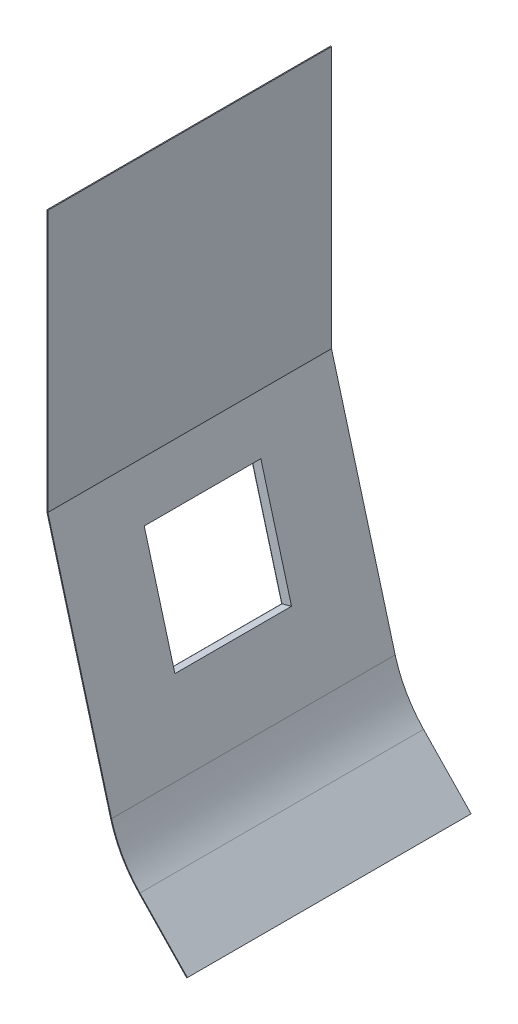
ISO-10303-21;
HEADER;
FILE_DESCRIPTION(('STEP AP214'),'2;1');
FILE_NAME('part.step','',(''),(''),'','','');
FILE_SCHEMA(('AUTOMOTIVE_DESIGN { 1 0 10303 214 1 1 1 1 }'));
ENDSEC;
DATA;
#1=APPLICATION_CONTEXT('core data for automotive mechanical design processes');
#2=APPLICATION_PROTOCOL_DEFINITION('international standard','automotive_design',2000,#1);
#3=PRODUCT_CONTEXT('',#1,'mechanical');
#4=PRODUCT('Part','Part','',(#3));
#5=PRODUCT_RELATED_PRODUCT_CATEGORY('part','',(#4));
#6=PRODUCT_DEFINITION_FORMATION('','',#4);
#7=PRODUCT_DEFINITION_CONTEXT('part definition',#1,'design');
#8=PRODUCT_DEFINITION('design','',#6,#7);
#9=PRODUCT_DEFINITION_SHAPE('','',#8);
#10=(LENGTH_UNIT() NAMED_UNIT(*) SI_UNIT(.MILLI.,.METRE.));
#11=(NAMED_UNIT(*) PLANE_ANGLE_UNIT() SI_UNIT($,.RADIAN.));
#12=(NAMED_UNIT(*) SI_UNIT($,.STERADIAN.) SOLID_ANGLE_UNIT());
#13=UNCERTAINTY_MEASURE_WITH_UNIT(LENGTH_MEASURE(1.E-05),#10,'distance_accuracy_value','');
#14=(GEOMETRIC_REPRESENTATION_CONTEXT(3) GLOBAL_UNCERTAINTY_ASSIGNED_CONTEXT((#13)) GLOBAL_UNIT_ASSIGNED_CONTEXT((#10,
#11,#12)) REPRESENTATION_CONTEXT('',''));
#15=CARTESIAN_POINT('',(0.,0.,0.));
#16=DIRECTION('',(0.,0.,1.));
#17=DIRECTION('',(1.,0.,0.));
#18=AXIS2_PLACEMENT_3D('',#15,#16,#17);
#19=CARTESIAN_POINT('',(-1959.57718450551,1358.98056887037,1192.));
#20=DIRECTION('',(0.964747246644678,0.263178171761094,0.));
#21=DIRECTION('',(-0.263178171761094,0.964747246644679,0.));
#22=AXIS2_PLACEMENT_3D('',#19,#20,#21);
#23=PLANE('',#22);
#24=DIRECTION('',(0.263178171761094,-0.964747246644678,0.));
#25=VECTOR('',#24,1.);
#26=CARTESIAN_POINT('',(-1959.57718450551,1358.98056887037,0.));
#27=LINE('',#26,#25);
#28=CARTESIAN_POINT('',(-1959.57718450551,1358.98056887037,0.));
#29=VERTEX_POINT('',#28);
#30=CARTESIAN_POINT('',(-1691.95080782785,377.927283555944,0.));
#31=VERTEX_POINT('',#30);
#32=EDGE_CURVE('E305',#29,#31,#27,.T.);
#33=ORIENTED_EDGE('',*,*,#32,.T.);
#34=DIRECTION('',(0.,0.,-1.));
#35=VECTOR('',#34,1.);
#36=CARTESIAN_POINT('',(-1691.95080782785,377.927283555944,1192.));
#37=LINE('',#36,#35);
#38=CARTESIAN_POINT('',(-1691.95080782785,377.927283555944,1192.));
#39=VERTEX_POINT('',#38);
#40=EDGE_CURVE('E340',#39,#31,#37,.T.);
#41=ORIENTED_EDGE('',*,*,#40,.F.);
#42=DIRECTION('',(0.263178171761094,-0.964747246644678,0.));
#43=VECTOR('',#42,1.);
#44=CARTESIAN_POINT('',(-1959.57718450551,1358.98056887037,1192.));
#45=LINE('',#44,#43);
#46=CARTESIAN_POINT('',(-1959.57718450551,1358.98056887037,1192.));
#47=VERTEX_POINT('',#46);
#48=EDGE_CURVE('E284',#47,#39,#45,.T.);
#49=ORIENTED_EDGE('',*,*,#48,.F.);
#50=DIRECTION('',(0.,0.,-1.));
#51=VECTOR('',#50,1.);
#52=CARTESIAN_POINT('',(-1959.57718450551,1358.98056887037,1192.));
#53=LINE('',#52,#51);
#54=EDGE_CURVE('E343',#47,#29,#53,.T.);
#55=ORIENTED_EDGE('',*,*,#54,.T.);
#56=EDGE_LOOP('',(#33,#41,#49,#55));
#57=FACE_BOUND('',#56,.T.);
#58=DIRECTION('',(0.,0.,1.));
#59=VECTOR('',#58,1.);
#60=CARTESIAN_POINT('',(-1775.47463143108,684.105331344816,347.));
#61=LINE('',#60,#59);
#62=CARTESIAN_POINT('',(-1775.47463143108,684.105331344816,347.));
#63=VERTEX_POINT('',#62);
#64=CARTESIAN_POINT('',(-1775.47463143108,684.105331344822,845.));
#65=VERTEX_POINT('',#64);
#66=EDGE_CURVE('E235',#63,#65,#61,.T.);
#67=ORIENTED_EDGE('',*,*,#66,.F.);
#68=DIRECTION('',(0.263178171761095,-0.964747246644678,0.));
#69=VECTOR('',#68,1.);
#70=CARTESIAN_POINT('',(-1775.47463143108,684.105331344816,347.));
#71=LINE('',#70,#69);
#72=CARTESIAN_POINT('',(-1906.53736096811,1164.54946017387,347.));
#73=VERTEX_POINT('',#72);
#74=EDGE_CURVE('E242',#73,#63,#71,.T.);
#75=ORIENTED_EDGE('',*,*,#74,.F.);
#76=DIRECTION('',(0.,0.,-1.));
#77=VECTOR('',#76,1.);
#78=CARTESIAN_POINT('',(-1906.53736096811,1164.54946017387,347.));
#79=LINE('',#78,#77);
#80=CARTESIAN_POINT('',(-1906.53736096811,1164.54946017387,845.));
#81=VERTEX_POINT('',#80);
#82=EDGE_CURVE('E255',#81,#73,#79,.T.);
#83=ORIENTED_EDGE('',*,*,#82,.F.);
#84=DIRECTION('',(-0.263178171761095,0.964747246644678,0.));
#85=VECTOR('',#84,1.);
#86=CARTESIAN_POINT('',(-1775.47463143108,684.105331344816,845.));
#87=LINE('',#86,#85);
#88=EDGE_CURVE('E250',#65,#81,#87,.T.);
#89=ORIENTED_EDGE('',*,*,#88,.F.);
#90=EDGE_LOOP('',(#67,#75,#83,#89));
#91=FACE_BOUND('',#90,.T.);
#92=ADVANCED_FACE('F33',(#57,#91),#23,.F.);
#93=CARTESIAN_POINT('',(-1955.57718450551,2458.98056887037,1192.));
#94=DIRECTION('',(0.,-1.,0.));
#95=DIRECTION('',(0.,0.,-1.));
#96=AXIS2_PLACEMENT_3D('',#93,#94,#95);
#97=PLANE('',#96);
#98=DIRECTION('',(-1.,0.,0.));
#99=VECTOR('',#98,1.);
#100=CARTESIAN_POINT('',(-1955.57718450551,2458.98056887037,0.));
#101=LINE('',#100,#99);
#102=CARTESIAN_POINT('',(-1955.57718450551,2458.98056887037,0.));
#103=VERTEX_POINT('',#102);
#104=CARTESIAN_POINT('',(-1959.57718450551,2458.98056887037,0.));
#105=VERTEX_POINT('',#104);
#106=EDGE_CURVE('E269',#103,#105,#101,.T.);
#107=ORIENTED_EDGE('',*,*,#106,.T.);
#108=DIRECTION('',(0.,0.,-1.));
#109=VECTOR('',#108,1.);
#110=CARTESIAN_POINT('',(-1959.57718450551,2458.98056887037,1192.));
#111=LINE('',#110,#109);
#112=CARTESIAN_POINT('',(-1959.57718450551,2458.98056887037,1192.));
#113=VERTEX_POINT('',#112);
#114=EDGE_CURVE('E346',#113,#105,#111,.T.);
#115=ORIENTED_EDGE('',*,*,#114,.F.);
#116=DIRECTION('',(-1.,0.,0.));
#117=VECTOR('',#116,1.);
#118=CARTESIAN_POINT('',(-1955.57718450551,2458.98056887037,1192.));
#119=LINE('',#118,#117);
#120=CARTESIAN_POINT('',(-1955.57718450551,2458.98056887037,1192.));
#121=VERTEX_POINT('',#120);
#122=EDGE_CURVE('E278',#121,#113,#119,.T.);
#123=ORIENTED_EDGE('',*,*,#122,.F.);
#124=DIRECTION('',(0.,0.,-1.));
#125=VECTOR('',#124,1.);
#126=CARTESIAN_POINT('',(-1955.57718450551,2458.98056887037,1192.));
#127=LINE('',#126,#125);
#128=EDGE_CURVE('E300',#121,#103,#127,.T.);
#129=ORIENTED_EDGE('',*,*,#128,.T.);
#130=EDGE_LOOP('',(#107,#115,#123,#129));
#131=FACE_BOUND('',#130,.T.);
#132=ADVANCED_FACE('F701',(#131),#97,.F.);
#133=CARTESIAN_POINT('',(-1959.57718450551,2458.98056887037,1192.));
#134=DIRECTION('',(1.,0.,0.));
#135=DIRECTION('',(0.,1.,0.));
#136=AXIS2_PLACEMENT_3D('',#133,#134,#135);
#137=PLANE('',#136);
#138=DIRECTION('',(0.,-1.,0.));
#139=VECTOR('',#138,1.);
#140=CARTESIAN_POINT('',(-1959.57718450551,2458.98056887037,0.));
#141=LINE('',#140,#139);
#142=EDGE_CURVE('E303',#105,#29,#141,.T.);
#143=ORIENTED_EDGE('',*,*,#142,.T.);
#144=ORIENTED_EDGE('',*,*,#54,.F.);
#145=DIRECTION('',(0.,-1.,0.));
#146=VECTOR('',#145,1.);
#147=CARTESIAN_POINT('',(-1959.57718450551,2458.98056887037,1192.));
#148=LINE('',#147,#146);
#149=EDGE_CURVE('E281',#113,#47,#148,.T.);
#150=ORIENTED_EDGE('',*,*,#149,.F.);
#151=ORIENTED_EDGE('',*,*,#114,.T.);
#152=EDGE_LOOP('',(#143,#144,#150,#151));
#153=FACE_BOUND('',#152,.T.);
#154=ADVANCED_FACE('F707',(#153),#137,.F.);
#155=CARTESIAN_POINT('',(-1209.57721875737,509.516494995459,1192.));
#156=DIRECTION('',(0.,0.,-1.));
#157=DIRECTION('',(-1.,0.,0.));
#158=AXIS2_PLACEMENT_3D('',#155,#156,#157);
#159=CYLINDRICAL_SURFACE('',#158,500.000000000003);
#160=CARTESIAN_POINT('',(-1209.57721875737,509.516494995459,0.));
#161=DIRECTION('',(0.,0.,1.));
#162=DIRECTION('',(1.,0.,0.));
#163=AXIS2_PLACEMENT_3D('',#160,#161,#162);
#164=CIRCLE('',#163,500.000000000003);
#165=CARTESIAN_POINT('',(-1571.83823613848,164.890675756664,0.));
#166=VERTEX_POINT('',#165);
#167=EDGE_CURVE('E307',#31,#166,#164,.T.);
#168=ORIENTED_EDGE('',*,*,#167,.T.);
#169=DIRECTION('',(0.,0.,-1.));
#170=VECTOR('',#169,1.);
#171=CARTESIAN_POINT('',(-1571.83823613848,164.890675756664,1192.));
#172=LINE('',#171,#170);
#173=CARTESIAN_POINT('',(-1571.83823613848,164.890675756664,1192.));
#174=VERTEX_POINT('',#173);
#175=EDGE_CURVE('E337',#174,#166,#172,.T.);
#176=ORIENTED_EDGE('',*,*,#175,.F.);
#177=CARTESIAN_POINT('',(-1209.57721875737,509.516494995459,1192.));
#178=DIRECTION('',(0.,0.,1.));
#179=DIRECTION('',(1.,0.,0.));
#180=AXIS2_PLACEMENT_3D('',#177,#178,#179);
#181=CIRCLE('',#180,500.000000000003);
#182=EDGE_CURVE('E286',#39,#174,#181,.T.);
#183=ORIENTED_EDGE('',*,*,#182,.F.);
#184=ORIENTED_EDGE('',*,*,#40,.T.);
#185=EDGE_LOOP('',(#168,#176,#183,#184));
#186=FACE_BOUND('',#185,.T.);
#187=ADVANCED_FACE('F712',(#186),#159,.T.);
#188=CARTESIAN_POINT('',(-1372.00823613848,-42.8511178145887,1192.));
#189=DIRECTION('',(0.720697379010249,0.693249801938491,0.));
#190=DIRECTION('',(-0.693249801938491,0.720697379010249,0.));
#191=AXIS2_PLACEMENT_3D('',#188,#189,#190);
#192=PLANE('',#191);
#193=DIRECTION('',(0.693249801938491,-0.720697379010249,0.));
#194=VECTOR('',#193,1.);
#195=CARTESIAN_POINT('',(-1372.00823613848,-42.8511178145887,0.));
#196=LINE('',#195,#194);
#197=CARTESIAN_POINT('',(-1372.00823613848,-42.8511178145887,0.));
#198=VERTEX_POINT('',#197);
#199=EDGE_CURVE('E309',#166,#198,#196,.T.);
#200=ORIENTED_EDGE('',*,*,#199,.T.);
#201=DIRECTION('',(0.,0.,-1.));
#202=VECTOR('',#201,1.);
#203=CARTESIAN_POINT('',(-1372.00823613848,-42.8511178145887,1192.));
#204=LINE('',#203,#202);
#205=CARTESIAN_POINT('',(-1372.00823613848,-42.8511178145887,1192.));
#206=VERTEX_POINT('',#205);
#207=EDGE_CURVE('E334',#206,#198,#204,.T.);
#208=ORIENTED_EDGE('',*,*,#207,.F.);
#209=DIRECTION('',(0.693249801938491,-0.720697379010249,0.));
#210=VECTOR('',#209,1.);
#211=CARTESIAN_POINT('',(-1372.00823613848,-42.8511178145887,1192.));
#212=LINE('',#211,#210);
#213=EDGE_CURVE('E288',#174,#206,#212,.T.);
#214=ORIENTED_EDGE('',*,*,#213,.F.);
#215=ORIENTED_EDGE('',*,*,#175,.T.);
#216=EDGE_LOOP('',(#200,#208,#214,#215));
#217=FACE_BOUND('',#216,.T.);
#218=ADVANCED_FACE('F796',(#217),#192,.F.);
#219=CARTESIAN_POINT('',(-1372.00823613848,-42.8511178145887,1192.));
#220=DIRECTION('',(-0.693249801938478,0.720697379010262,0.));
#221=DIRECTION('',(-0.720697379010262,-0.693249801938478,0.));
#222=AXIS2_PLACEMENT_3D('',#219,#220,#221);
#223=PLANE('',#222);
#224=DIRECTION('',(0.720697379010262,0.693249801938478,0.));
#225=VECTOR('',#224,1.);
#226=CARTESIAN_POINT('',(-1372.00823613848,-42.8511178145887,0.));
#227=LINE('',#226,#225);
#228=CARTESIAN_POINT('',(-1369.12544662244,-40.078118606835,0.));
#229=VERTEX_POINT('',#228);
#230=EDGE_CURVE('E311',#198,#229,#227,.T.);
#231=ORIENTED_EDGE('',*,*,#230,.T.);
#232=DIRECTION('',(0.,0.,-1.));
#233=VECTOR('',#232,1.);
#234=CARTESIAN_POINT('',(-1369.12544662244,-40.078118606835,1192.));
#235=LINE('',#234,#233);
#236=CARTESIAN_POINT('',(-1369.12544662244,-40.078118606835,1192.));
#237=VERTEX_POINT('',#236);
#238=EDGE_CURVE('E331',#237,#229,#235,.T.);
#239=ORIENTED_EDGE('',*,*,#238,.F.);
#240=DIRECTION('',(0.720697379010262,0.693249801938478,0.));
#241=VECTOR('',#240,1.);
#242=CARTESIAN_POINT('',(-1372.00823613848,-42.8511178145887,1192.));
#243=LINE('',#242,#241);
#244=EDGE_CURVE('E290',#206,#237,#243,.T.);
#245=ORIENTED_EDGE('',*,*,#244,.F.);
#246=ORIENTED_EDGE('',*,*,#207,.T.);
#247=EDGE_LOOP('',(#231,#239,#245,#246));
#248=FACE_BOUND('',#247,.T.);
#249=ADVANCED_FACE('F793',(#248),#223,.F.);
#250=CARTESIAN_POINT('',(-1568.95544662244,167.663674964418,1192.));
#251=DIRECTION('',(-0.720697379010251,-0.69324980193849,0.));
#252=DIRECTION('',(0.69324980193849,-0.720697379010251,0.));
#253=AXIS2_PLACEMENT_3D('',#250,#251,#252);
#254=PLANE('',#253);
#255=DIRECTION('',(-0.69324980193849,0.72069737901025,0.));
#256=VECTOR('',#255,1.);
#257=CARTESIAN_POINT('',(-1568.95544662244,167.663674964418,0.));
#258=LINE('',#257,#256);
#259=CARTESIAN_POINT('',(-1568.95544662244,167.663674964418,0.));
#260=VERTEX_POINT('',#259);
#261=EDGE_CURVE('E313',#229,#260,#258,.T.);
#262=ORIENTED_EDGE('',*,*,#261,.T.);
#263=DIRECTION('',(0.,0.,-1.));
#264=VECTOR('',#263,1.);
#265=CARTESIAN_POINT('',(-1568.95544662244,167.663674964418,1192.));
#266=LINE('',#265,#264);
#267=CARTESIAN_POINT('',(-1568.95544662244,167.663674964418,1192.));
#268=VERTEX_POINT('',#267);
#269=EDGE_CURVE('E328',#268,#260,#266,.T.);
#270=ORIENTED_EDGE('',*,*,#269,.F.);
#271=DIRECTION('',(-0.69324980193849,0.72069737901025,0.));
#272=VECTOR('',#271,1.);
#273=CARTESIAN_POINT('',(-1568.95544662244,167.663674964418,1192.));
#274=LINE('',#273,#272);
#275=EDGE_CURVE('E292',#237,#268,#274,.T.);
#276=ORIENTED_EDGE('',*,*,#275,.F.);
#277=ORIENTED_EDGE('',*,*,#238,.T.);
#278=EDGE_LOOP('',(#262,#270,#276,#277));
#279=FACE_BOUND('',#278,.T.);
#280=ADVANCED_FACE('F789',(#279),#254,.F.);
#281=CARTESIAN_POINT('',(-1209.5771845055,509.516369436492,1192.));
#282=DIRECTION('',(0.,0.,-1.));
#283=DIRECTION('',(-1.,0.,0.));
#284=AXIS2_PLACEMENT_3D('',#281,#282,#283);
#285=CYLINDRICAL_SURFACE('',#284,496.000000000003);
#286=CARTESIAN_POINT('',(-1209.5771845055,509.516369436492,0.));
#287=DIRECTION('',(0.,0.,-1.));
#288=DIRECTION('',(1.,0.,0.));
#289=AXIS2_PLACEMENT_3D('',#286,#287,#288);
#290=CIRCLE('',#289,496.000000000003);
#291=CARTESIAN_POINT('',(-1688.09181884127,378.979996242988,0.));
#292=VERTEX_POINT('',#291);
#293=EDGE_CURVE('E315',#260,#292,#290,.T.);
#294=ORIENTED_EDGE('',*,*,#293,.T.);
#295=DIRECTION('',(0.,0.,-1.));
#296=VECTOR('',#295,1.);
#297=CARTESIAN_POINT('',(-1688.09181884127,378.979996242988,1192.));
#298=LINE('',#297,#296);
#299=CARTESIAN_POINT('',(-1688.09181884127,378.979996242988,1192.));
#300=VERTEX_POINT('',#299);
#301=EDGE_CURVE('E325',#300,#292,#298,.T.);
#302=ORIENTED_EDGE('',*,*,#301,.F.);
#303=CARTESIAN_POINT('',(-1209.5771845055,509.516369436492,1192.));
#304=DIRECTION('',(0.,0.,-1.));
#305=DIRECTION('',(1.,0.,0.));
#306=AXIS2_PLACEMENT_3D('',#303,#304,#305);
#307=CIRCLE('',#306,496.000000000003);
#308=EDGE_CURVE('E294',#268,#300,#307,.T.);
#309=ORIENTED_EDGE('',*,*,#308,.F.);
#310=ORIENTED_EDGE('',*,*,#269,.T.);
#311=EDGE_LOOP('',(#294,#302,#309,#310));
#312=FACE_BOUND('',#311,.T.);
#313=ADVANCED_FACE('F786',(#312),#285,.F.);
#314=CARTESIAN_POINT('',(-1955.57718450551,1359.51636943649,1192.));
#315=DIRECTION('',(-0.964747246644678,-0.263178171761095,0.));
#316=DIRECTION('',(0.263178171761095,-0.964747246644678,0.));
#317=AXIS2_PLACEMENT_3D('',#314,#315,#316);
#318=PLANE('',#317);
#319=DIRECTION('',(0.,0.,1.));
#320=VECTOR('',#319,1.);
#321=CARTESIAN_POINT('',(-1772.66835513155,689.017033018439,1192.));
#322=LINE('',#321,#320);
#323=CARTESIAN_POINT('',(-1772.66835513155,689.017033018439,351.));
#324=VERTEX_POINT('',#323);
#325=CARTESIAN_POINT('',(-1772.66835513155,689.017033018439,841.));
#326=VERTEX_POINT('',#325);
#327=EDGE_CURVE('E355',#324,#326,#322,.T.);
#328=ORIENTED_EDGE('',*,*,#327,.T.);
#329=DIRECTION('',(-0.263178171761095,0.964747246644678,0.));
#330=VECTOR('',#329,1.);
#331=CARTESIAN_POINT('',(-1955.57718450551,1359.51636943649,841.));
#332=LINE('',#331,#330);
#333=CARTESIAN_POINT('',(-1901.62565929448,1161.74318387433,841.));
#334=VERTEX_POINT('',#333);
#335=EDGE_CURVE('E358',#326,#334,#332,.T.);
#336=ORIENTED_EDGE('',*,*,#335,.T.);
#337=DIRECTION('',(0.,0.,-1.));
#338=VECTOR('',#337,1.);
#339=CARTESIAN_POINT('',(-1901.62565929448,1161.74318387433,1192.));
#340=LINE('',#339,#338);
#341=CARTESIAN_POINT('',(-1901.62565929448,1161.74318387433,351.));
#342=VERTEX_POINT('',#341);
#343=EDGE_CURVE('E349',#334,#342,#340,.T.);
#344=ORIENTED_EDGE('',*,*,#343,.T.);
#345=DIRECTION('',(0.263178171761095,-0.964747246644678,0.));
#346=VECTOR('',#345,1.);
#347=CARTESIAN_POINT('',(-1955.57718450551,1359.51636943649,351.));
#348=LINE('',#347,#346);
#349=EDGE_CURVE('E352',#342,#324,#348,.T.);
#350=ORIENTED_EDGE('',*,*,#349,.T.);
#351=EDGE_LOOP('',(#328,#336,#344,#350));
#352=FACE_BOUND('',#351,.T.);
#353=DIRECTION('',(-0.263178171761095,0.964747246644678,0.));
#354=VECTOR('',#353,1.);
#355=CARTESIAN_POINT('',(-1955.57718450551,1359.51636943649,0.));
#356=LINE('',#355,#354);
#357=CARTESIAN_POINT('',(-1955.57718450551,1359.51636943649,0.));
#358=VERTEX_POINT('',#357);
#359=EDGE_CURVE('E317',#292,#358,#356,.T.);
#360=ORIENTED_EDGE('',*,*,#359,.T.);
#361=DIRECTION('',(0.,0.,-1.));
#362=VECTOR('',#361,1.);
#363=CARTESIAN_POINT('',(-1955.57718450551,1359.51636943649,1192.));
#364=LINE('',#363,#362);
#365=CARTESIAN_POINT('',(-1955.57718450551,1359.51636943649,1192.));
#366=VERTEX_POINT('',#365);
#367=EDGE_CURVE('E322',#366,#358,#364,.T.);
#368=ORIENTED_EDGE('',*,*,#367,.F.);
#369=DIRECTION('',(-0.263178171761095,0.964747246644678,0.));
#370=VECTOR('',#369,1.);
#371=CARTESIAN_POINT('',(-1955.57718450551,1359.51636943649,1192.));
#372=LINE('',#371,#370);
#373=EDGE_CURVE('E296',#300,#366,#372,.T.);
#374=ORIENTED_EDGE('',*,*,#373,.F.);
#375=ORIENTED_EDGE('',*,*,#301,.T.);
#376=EDGE_LOOP('',(#360,#368,#374,#375));
#377=FACE_BOUND('',#376,.T.);
#378=ADVANCED_FACE('F680',(#352,#377),#318,.F.);
#379=CARTESIAN_POINT('',(-1955.57718450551,2458.98056887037,1192.));
#380=DIRECTION('',(-1.,0.,0.));
#381=DIRECTION('',(0.,0.,1.));
#382=AXIS2_PLACEMENT_3D('',#379,#380,#381);
#383=PLANE('',#382);
#384=DIRECTION('',(0.,1.,0.));
#385=VECTOR('',#384,1.);
#386=CARTESIAN_POINT('',(-1955.57718450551,2458.98056887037,0.));
#387=LINE('',#386,#385);
#388=EDGE_CURVE('E282',#358,#103,#387,.T.);
#389=ORIENTED_EDGE('',*,*,#388,.T.);
#390=ORIENTED_EDGE('',*,*,#128,.F.);
#391=DIRECTION('',(0.,1.,0.));
#392=VECTOR('',#391,1.);
#393=CARTESIAN_POINT('',(-1955.57718450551,2458.98056887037,1192.));
#394=LINE('',#393,#392);
#395=EDGE_CURVE('E298',#366,#121,#394,.T.);
#396=ORIENTED_EDGE('',*,*,#395,.F.);
#397=ORIENTED_EDGE('',*,*,#367,.T.);
#398=EDGE_LOOP('',(#389,#390,#396,#397));
#399=FACE_BOUND('',#398,.T.);
#400=ADVANCED_FACE('F778',(#399),#383,.F.);
#401=CARTESIAN_POINT('',(-1209.57721875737,509.516494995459,1192.));
#402=DIRECTION('',(0.,0.,1.));
#403=DIRECTION('',(1.,0.,0.));
#404=AXIS2_PLACEMENT_3D('',#401,#402,#403);
#405=PLANE('',#404);
#406=ORIENTED_EDGE('',*,*,#122,.T.);
#407=ORIENTED_EDGE('',*,*,#149,.T.);
#408=ORIENTED_EDGE('',*,*,#48,.T.);
#409=ORIENTED_EDGE('',*,*,#182,.T.);
#410=ORIENTED_EDGE('',*,*,#213,.T.);
#411=ORIENTED_EDGE('',*,*,#244,.T.);
#412=ORIENTED_EDGE('',*,*,#275,.T.);
#413=ORIENTED_EDGE('',*,*,#308,.T.);
#414=ORIENTED_EDGE('',*,*,#373,.T.);
#415=ORIENTED_EDGE('',*,*,#395,.T.);
#416=EDGE_LOOP('',(#406,#407,#408,#409,#410,#411,#412,#413,#414,#415));
#417=FACE_BOUND('',#416,.T.);
#418=ADVANCED_FACE('F773',(#417),#405,.T.);
#419=CARTESIAN_POINT('',(-1209.57721875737,509.516494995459,0.));
#420=DIRECTION('',(0.,0.,1.));
#421=DIRECTION('',(1.,0.,0.));
#422=AXIS2_PLACEMENT_3D('',#419,#420,#421);
#423=PLANE('',#422);
#424=ORIENTED_EDGE('',*,*,#106,.F.);
#425=ORIENTED_EDGE('',*,*,#388,.F.);
#426=ORIENTED_EDGE('',*,*,#359,.F.);
#427=ORIENTED_EDGE('',*,*,#293,.F.);
#428=ORIENTED_EDGE('',*,*,#261,.F.);
#429=ORIENTED_EDGE('',*,*,#230,.F.);
#430=ORIENTED_EDGE('',*,*,#199,.F.);
#431=ORIENTED_EDGE('',*,*,#167,.F.);
#432=ORIENTED_EDGE('',*,*,#32,.F.);
#433=ORIENTED_EDGE('',*,*,#142,.F.);
#434=EDGE_LOOP('',(#424,#425,#426,#427,#428,#429,#430,#431,#432,#433));
#435=FACE_BOUND('',#434,.T.);
#436=ADVANCED_FACE('F769',(#435),#423,.F.);
#437=CARTESIAN_POINT('',(-947.681459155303,914.06928765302,841.));
#438=DIRECTION('',(0.,0.,1.));
#439=DIRECTION('',(1.,0.,0.));
#440=AXIS2_PLACEMENT_3D('',#437,#438,#439);
#441=PLANE('',#440);
#442=DIRECTION('',(-0.964747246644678,-0.263178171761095,0.));
#443=VECTOR('',#442,1.);
#444=CARTESIAN_POINT('',(-947.681459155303,914.06928765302,841.));
#445=LINE('',#444,#443);
#446=CARTESIAN_POINT('',(-1812.22299224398,678.226727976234,841.));
#447=VERTEX_POINT('',#446);
#448=EDGE_CURVE('E266',#326,#447,#445,.T.);
#449=ORIENTED_EDGE('',*,*,#448,.T.);
#450=DIRECTION('',(-0.263178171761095,0.964747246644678,0.));
#451=VECTOR('',#450,1.);
#452=CARTESIAN_POINT('',(-1941.18029640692,1150.95287883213,841.));
#453=LINE('',#452,#451);
#454=CARTESIAN_POINT('',(-1941.18029640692,1150.95287883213,841.));
#455=VERTEX_POINT('',#454);
#456=EDGE_CURVE('E375',#447,#455,#453,.T.);
#457=ORIENTED_EDGE('',*,*,#456,.T.);
#458=DIRECTION('',(-0.964747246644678,-0.263178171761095,0.));
#459=VECTOR('',#458,1.);
#460=CARTESIAN_POINT('',(-1076.63876331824,1386.79543850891,841.));
#461=LINE('',#460,#459);
#462=EDGE_CURVE('E265',#334,#455,#461,.T.);
#463=ORIENTED_EDGE('',*,*,#462,.F.);
#464=ORIENTED_EDGE('',*,*,#335,.F.);
#465=EDGE_LOOP('',(#449,#457,#463,#464));
#466=FACE_BOUND('',#465,.T.);
#467=ADVANCED_FACE('F678',(#466),#441,.F.);
#468=CARTESIAN_POINT('',(-947.681459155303,914.06928765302,351.));
#469=DIRECTION('',(0.263178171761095,-0.964747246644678,0.));
#470=DIRECTION('',(0.964747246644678,0.263178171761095,0.));
#471=AXIS2_PLACEMENT_3D('',#468,#469,#470);
#472=PLANE('',#471);
#473=DIRECTION('',(-0.964747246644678,-0.263178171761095,0.));
#474=VECTOR('',#473,1.);
#475=CARTESIAN_POINT('',(-947.681459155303,914.06928765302,351.));
#476=LINE('',#475,#474);
#477=CARTESIAN_POINT('',(-1812.22299224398,678.226727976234,351.));
#478=VERTEX_POINT('',#477);
#479=EDGE_CURVE('E270',#324,#478,#476,.T.);
#480=ORIENTED_EDGE('',*,*,#479,.T.);
#481=DIRECTION('',(0.,0.,1.));
#482=VECTOR('',#481,1.);
#483=CARTESIAN_POINT('',(-1812.22299224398,678.226727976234,841.));
#484=LINE('',#483,#482);
#485=EDGE_CURVE('E361',#478,#447,#484,.T.);
#486=ORIENTED_EDGE('',*,*,#485,.T.);
#487=ORIENTED_EDGE('',*,*,#448,.F.);
#488=ORIENTED_EDGE('',*,*,#327,.F.);
#489=EDGE_LOOP('',(#480,#486,#487,#488));
#490=FACE_BOUND('',#489,.T.);
#491=ADVANCED_FACE('F676',(#490),#472,.F.);
#492=CARTESIAN_POINT('',(-947.681459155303,914.06928765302,351.));
#493=DIRECTION('',(0.,0.,-1.));
#494=DIRECTION('',(-1.,0.,0.));
#495=AXIS2_PLACEMENT_3D('',#492,#493,#494);
#496=PLANE('',#495);
#497=DIRECTION('',(-0.964747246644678,-0.263178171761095,0.));
#498=VECTOR('',#497,1.);
#499=CARTESIAN_POINT('',(-1076.63876331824,1386.79543850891,351.));
#500=LINE('',#499,#498);
#501=CARTESIAN_POINT('',(-1941.18029640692,1150.95287883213,351.));
#502=VERTEX_POINT('',#501);
#503=EDGE_CURVE('E273',#342,#502,#500,.T.);
#504=ORIENTED_EDGE('',*,*,#503,.T.);
#505=DIRECTION('',(0.263178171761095,-0.964747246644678,0.));
#506=VECTOR('',#505,1.);
#507=CARTESIAN_POINT('',(-1812.22299224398,678.226727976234,351.));
#508=LINE('',#507,#506);
#509=EDGE_CURVE('E373',#502,#478,#508,.T.);
#510=ORIENTED_EDGE('',*,*,#509,.T.);
#511=ORIENTED_EDGE('',*,*,#479,.F.);
#512=ORIENTED_EDGE('',*,*,#349,.F.);
#513=EDGE_LOOP('',(#504,#510,#511,#512));
#514=FACE_BOUND('',#513,.T.);
#515=ADVANCED_FACE('F684',(#514),#496,.F.);
#516=CARTESIAN_POINT('',(-1076.63876331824,1386.79543850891,351.));
#517=DIRECTION('',(-0.263178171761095,0.964747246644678,0.));
#518=DIRECTION('',(-0.964747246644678,-0.263178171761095,0.));
#519=AXIS2_PLACEMENT_3D('',#516,#517,#518);
#520=PLANE('',#519);
#521=ORIENTED_EDGE('',*,*,#462,.T.);
#522=DIRECTION('',(0.,0.,-1.));
#523=VECTOR('',#522,1.);
#524=CARTESIAN_POINT('',(-1941.18029640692,1150.95287883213,351.));
#525=LINE('',#524,#523);
#526=EDGE_CURVE('E377',#455,#502,#525,.T.);
#527=ORIENTED_EDGE('',*,*,#526,.T.);
#528=ORIENTED_EDGE('',*,*,#503,.F.);
#529=ORIENTED_EDGE('',*,*,#343,.F.);
#530=EDGE_LOOP('',(#521,#527,#528,#529));
#531=FACE_BOUND('',#530,.T.);
#532=ADVANCED_FACE('F630',(#531),#520,.F.);
#533=CARTESIAN_POINT('',(-1519.32513148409,-414.46421516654,0.));
#534=DIRECTION('',(-0.964747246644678,-0.263178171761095,0.));
#535=DIRECTION('',(0.263178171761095,-0.964747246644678,0.));
#536=AXIS2_PLACEMENT_3D('',#533,#534,#535);
#537=PLANE('',#536);
#538=CARTESIAN_POINT('',(-1928.89745147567,1086.92841694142,331.));
#539=DIRECTION('',(-0.964747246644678,-0.263178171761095,0.));
#540=DIRECTION('',(0.263178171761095,-0.964747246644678,0.));
#541=AXIS2_PLACEMENT_3D('',#538,#539,#540);
#542=CIRCLE('',#541,6.00000000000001);
#543=CARTESIAN_POINT('',(-1927.3183824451,1081.13993346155,331.));
#544=VERTEX_POINT('',#543);
#545=EDGE_CURVE('E600',#544,#544,#542,.T.);
#546=ORIENTED_EDGE('',*,*,#545,.F.);
#547=EDGE_LOOP('',(#546));
#548=FACE_BOUND('',#547,.T.);
#549=CARTESIAN_POINT('',(-1928.89745147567,1086.92841694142,861.));
#550=DIRECTION('',(-0.964747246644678,-0.263178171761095,0.));
#551=DIRECTION('',(0.263178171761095,-0.964747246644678,0.));
#552=AXIS2_PLACEMENT_3D('',#549,#550,#551);
#553=CIRCLE('',#552,6.00000000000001);
#554=CARTESIAN_POINT('',(-1927.3183824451,1081.13993346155,861.));
#555=VERTEX_POINT('',#554);
#556=EDGE_CURVE('E606',#555,#555,#553,.T.);
#557=ORIENTED_EDGE('',*,*,#556,.F.);
#558=EDGE_LOOP('',(#557));
#559=FACE_BOUND('',#558,.T.);
#560=CARTESIAN_POINT('',(-1897.31607086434,971.158747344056,331.));
#561=DIRECTION('',(-0.964747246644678,-0.263178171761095,0.));
#562=DIRECTION('',(0.263178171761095,-0.964747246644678,0.));
#563=AXIS2_PLACEMENT_3D('',#560,#561,#562);
#564=CIRCLE('',#563,6.00000000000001);
#565=CARTESIAN_POINT('',(-1895.73700183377,965.370263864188,331.));
#566=VERTEX_POINT('',#565);
#567=EDGE_CURVE('E612',#566,#566,#564,.T.);
#568=ORIENTED_EDGE('',*,*,#567,.F.);
#569=EDGE_LOOP('',(#568));
#570=FACE_BOUND('',#569,.T.);
#571=CARTESIAN_POINT('',(-1897.31607086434,971.158747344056,861.));
#572=DIRECTION('',(-0.964747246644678,-0.263178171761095,0.));
#573=DIRECTION('',(0.263178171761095,-0.964747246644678,0.));
#574=AXIS2_PLACEMENT_3D('',#571,#572,#573);
#575=CIRCLE('',#574,6.00000000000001);
#576=CARTESIAN_POINT('',(-1895.73700183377,965.370263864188,861.));
#577=VERTEX_POINT('',#576);
#578=EDGE_CURVE('E588',#577,#577,#575,.T.);
#579=ORIENTED_EDGE('',*,*,#578,.F.);
#580=EDGE_LOOP('',(#579));
#581=FACE_BOUND('',#580,.T.);
#582=CARTESIAN_POINT('',(-1865.73469025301,855.389077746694,331.));
#583=DIRECTION('',(-0.964747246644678,-0.263178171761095,0.));
#584=DIRECTION('',(0.263178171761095,-0.964747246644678,0.));
#585=AXIS2_PLACEMENT_3D('',#582,#583,#584);
#586=CIRCLE('',#585,6.00000000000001);
#587=CARTESIAN_POINT('',(-1864.15562122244,849.600594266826,331.));
#588=VERTEX_POINT('',#587);
#589=EDGE_CURVE('E595',#588,#588,#586,.T.);
#590=ORIENTED_EDGE('',*,*,#589,.F.);
#591=EDGE_LOOP('',(#590));
#592=FACE_BOUND('',#591,.T.);
#593=CARTESIAN_POINT('',(-1865.73469025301,855.389077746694,861.));
#594=DIRECTION('',(-0.964747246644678,-0.263178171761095,0.));
#595=DIRECTION('',(0.263178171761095,-0.964747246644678,0.));
#596=AXIS2_PLACEMENT_3D('',#593,#594,#595);
#597=CIRCLE('',#596,6.00000000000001);
#598=CARTESIAN_POINT('',(-1864.15562122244,849.600594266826,861.));
#599=VERTEX_POINT('',#598);
#600=EDGE_CURVE('E582',#599,#599,#597,.T.);
#601=ORIENTED_EDGE('',*,*,#600,.F.);
#602=EDGE_LOOP('',(#601));
#603=FACE_BOUND('',#602,.T.);
#604=CARTESIAN_POINT('',(-1951.26759607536,1168.93193290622,416.));
#605=DIRECTION('',(-0.964747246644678,-0.263178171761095,0.));
#606=DIRECTION('',(0.263178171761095,-0.964747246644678,0.));
#607=AXIS2_PLACEMENT_3D('',#604,#605,#606);
#608=CIRCLE('',#607,6.00000000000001);
#609=CARTESIAN_POINT('',(-1949.6885270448,1163.14344942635,416.));
#610=VERTEX_POINT('',#609);
#611=EDGE_CURVE('E564',#610,#610,#608,.T.);
#612=ORIENTED_EDGE('',*,*,#611,.F.);
#613=EDGE_LOOP('',(#612));
#614=FACE_BOUND('',#613,.T.);
#615=CARTESIAN_POINT('',(-1811.78316504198,657.615892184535,416.));
#616=DIRECTION('',(-0.964747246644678,-0.263178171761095,0.));
#617=DIRECTION('',(0.263178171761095,-0.964747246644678,0.));
#618=AXIS2_PLACEMENT_3D('',#615,#616,#617);
#619=CIRCLE('',#618,6.00000000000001);
#620=CARTESIAN_POINT('',(-1810.20409601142,651.827408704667,416.));
#621=VERTEX_POINT('',#620);
#622=EDGE_CURVE('E571',#621,#621,#619,.T.);
#623=ORIENTED_EDGE('',*,*,#622,.F.);
#624=EDGE_LOOP('',(#623));
#625=FACE_BOUND('',#624,.T.);
#626=CARTESIAN_POINT('',(-1951.26759607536,1168.93193290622,536.));
#627=DIRECTION('',(-0.964747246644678,-0.263178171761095,0.));
#628=DIRECTION('',(0.263178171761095,-0.964747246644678,0.));
#629=AXIS2_PLACEMENT_3D('',#626,#627,#628);
#630=CIRCLE('',#629,6.00000000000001);
#631=CARTESIAN_POINT('',(-1949.6885270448,1163.14344942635,536.));
#632=VERTEX_POINT('',#631);
#633=EDGE_CURVE('E577',#632,#632,#630,.T.);
#634=ORIENTED_EDGE('',*,*,#633,.F.);
#635=EDGE_LOOP('',(#634));
#636=FACE_BOUND('',#635,.T.);
#637=CARTESIAN_POINT('',(-1811.78316504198,657.615892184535,536.));
#638=DIRECTION('',(-0.964747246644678,-0.263178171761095,0.));
#639=DIRECTION('',(0.263178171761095,-0.964747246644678,0.));
#640=AXIS2_PLACEMENT_3D('',#637,#638,#639);
#641=CIRCLE('',#640,6.00000000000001);
#642=CARTESIAN_POINT('',(-1810.20409601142,651.827408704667,536.));
#643=VERTEX_POINT('',#642);
#644=EDGE_CURVE('E552',#643,#643,#641,.T.);
#645=ORIENTED_EDGE('',*,*,#644,.F.);
#646=EDGE_LOOP('',(#645));
#647=FACE_BOUND('',#646,.T.);
#648=CARTESIAN_POINT('',(-1951.26759607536,1168.93193290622,656.));
#649=DIRECTION('',(-0.964747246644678,-0.263178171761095,0.));
#650=DIRECTION('',(0.263178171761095,-0.964747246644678,0.));
#651=AXIS2_PLACEMENT_3D('',#648,#649,#650);
#652=CIRCLE('',#651,6.00000000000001);
#653=CARTESIAN_POINT('',(-1949.6885270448,1163.14344942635,656.));
#654=VERTEX_POINT('',#653);
#655=EDGE_CURVE('E559',#654,#654,#652,.T.);
#656=ORIENTED_EDGE('',*,*,#655,.F.);
#657=EDGE_LOOP('',(#656));
#658=FACE_BOUND('',#657,.T.);
#659=CARTESIAN_POINT('',(-1811.78316504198,657.615892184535,656.));
#660=DIRECTION('',(-0.964747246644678,-0.263178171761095,0.));
#661=DIRECTION('',(0.263178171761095,-0.964747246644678,0.));
#662=AXIS2_PLACEMENT_3D('',#659,#660,#661);
#663=CIRCLE('',#662,6.00000000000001);
#664=CARTESIAN_POINT('',(-1810.20409601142,651.827408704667,656.));
#665=VERTEX_POINT('',#664);
#666=EDGE_CURVE('E546',#665,#665,#663,.T.);
#667=ORIENTED_EDGE('',*,*,#666,.F.);
#668=EDGE_LOOP('',(#667));
#669=FACE_BOUND('',#668,.T.);
#670=CARTESIAN_POINT('',(-1834.15330964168,739.619408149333,331.));
#671=DIRECTION('',(-0.964747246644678,-0.263178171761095,0.));
#672=DIRECTION('',(0.263178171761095,-0.964747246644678,0.));
#673=AXIS2_PLACEMENT_3D('',#670,#671,#672);
#674=CIRCLE('',#673,6.00000000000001);
#675=CARTESIAN_POINT('',(-1832.57424061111,733.830924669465,331.));
#676=VERTEX_POINT('',#675);
#677=EDGE_CURVE('E537',#676,#676,#674,.T.);
#678=ORIENTED_EDGE('',*,*,#677,.F.);
#679=EDGE_LOOP('',(#678));
#680=FACE_BOUND('',#679,.T.);
#681=CARTESIAN_POINT('',(-1834.15330964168,739.619408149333,861.));
#682=DIRECTION('',(-0.964747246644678,-0.263178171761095,0.));
#683=DIRECTION('',(0.263178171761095,-0.964747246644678,0.));
#684=AXIS2_PLACEMENT_3D('',#681,#682,#683);
#685=CIRCLE('',#684,6.00000000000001);
#686=CARTESIAN_POINT('',(-1832.57424061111,733.830924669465,861.));
#687=VERTEX_POINT('',#686);
#688=EDGE_CURVE('E534',#687,#687,#685,.T.);
#689=ORIENTED_EDGE('',*,*,#688,.F.);
#690=EDGE_LOOP('',(#689));
#691=FACE_BOUND('',#690,.T.);
#692=CARTESIAN_POINT('',(-1951.26759607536,1168.93193290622,776.));
#693=DIRECTION('',(-0.964747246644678,-0.263178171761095,0.));
#694=DIRECTION('',(0.263178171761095,-0.964747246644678,0.));
#695=AXIS2_PLACEMENT_3D('',#692,#693,#694);
#696=CIRCLE('',#695,6.00000000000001);
#697=CARTESIAN_POINT('',(-1949.6885270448,1163.14344942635,776.));
#698=VERTEX_POINT('',#697);
#699=EDGE_CURVE('E528',#698,#698,#696,.T.);
#700=ORIENTED_EDGE('',*,*,#699,.F.);
#701=EDGE_LOOP('',(#700));
#702=FACE_BOUND('',#701,.T.);
#703=CARTESIAN_POINT('',(-1811.78316504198,657.615892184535,776.));
#704=DIRECTION('',(-0.964747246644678,-0.263178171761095,0.));
#705=DIRECTION('',(0.263178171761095,-0.964747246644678,0.));
#706=AXIS2_PLACEMENT_3D('',#703,#704,#705);
#707=CIRCLE('',#706,6.00000000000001);
#708=CARTESIAN_POINT('',(-1810.20409601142,651.827408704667,776.));
#709=VERTEX_POINT('',#708);
#710=EDGE_CURVE('E522',#709,#709,#707,.T.);
#711=ORIENTED_EDGE('',*,*,#710,.F.);
#712=EDGE_LOOP('',(#711));
#713=FACE_BOUND('',#712,.T.);
#714=DIRECTION('',(-0.263178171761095,0.964747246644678,0.));
#715=VECTOR('',#714,1.);
#716=CARTESIAN_POINT('',(-1817.0467284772,676.910837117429,846.));
#717=LINE('',#716,#715);
#718=CARTESIAN_POINT('',(-1947.31992349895,1154.46072420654,846.));
#719=VERTEX_POINT('',#718);
#720=CARTESIAN_POINT('',(-1815.7308376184,672.087100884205,846.));
#721=VERTEX_POINT('',#720);
#722=EDGE_CURVE('E366',#719,#721,#717,.F.);
#723=ORIENTED_EDGE('',*,*,#722,.T.);
#724=DIRECTION('',(0.,0.,1.));
#725=VECTOR('',#724,1.);
#726=CARTESIAN_POINT('',(-1815.7308376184,672.087100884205,351.));
#727=LINE('',#726,#725);
#728=CARTESIAN_POINT('',(-1815.7308376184,672.087100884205,346.));
#729=VERTEX_POINT('',#728);
#730=EDGE_CURVE('E370',#721,#729,#727,.F.);
#731=ORIENTED_EDGE('',*,*,#730,.T.);
#732=DIRECTION('',(0.263178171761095,-0.964747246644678,0.));
#733=VECTOR('',#732,1.);
#734=CARTESIAN_POINT('',(-1946.00403264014,1149.63698797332,346.));
#735=LINE('',#734,#733);
#736=CARTESIAN_POINT('',(-1947.31992349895,1154.46072420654,346.));
#737=VERTEX_POINT('',#736);
#738=EDGE_CURVE('E368',#729,#737,#735,.F.);
#739=ORIENTED_EDGE('',*,*,#738,.T.);
#740=DIRECTION('',(0.,0.,-1.));
#741=VECTOR('',#740,1.);
#742=CARTESIAN_POINT('',(-1947.31992349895,1154.46072420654,841.));
#743=LINE('',#742,#741);
#744=EDGE_CURVE('E364',#737,#719,#743,.F.);
#745=ORIENTED_EDGE('',*,*,#744,.T.);
#746=EDGE_LOOP('',(#723,#731,#739,#745));
#747=FACE_BOUND('',#746,.T.);
#748=DIRECTION('',(0.,0.,-1.));
#749=VECTOR('',#748,1.);
#750=CARTESIAN_POINT('',(-1955.21526865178,1183.40314160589,316.));
#751=LINE('',#750,#749);
#752=CARTESIAN_POINT('',(-1955.21526865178,1183.40314160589,841.));
#753=VERTEX_POINT('',#752);
#754=CARTESIAN_POINT('',(-1955.21526865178,1183.40314160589,351.));
#755=VERTEX_POINT('',#754);
#756=EDGE_CURVE('E463',#753,#755,#751,.T.);
#757=ORIENTED_EDGE('',*,*,#756,.T.);
#758=CARTESIAN_POINT('',(-1946.00403264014,1149.63698797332,351.));
#759=DIRECTION('',(-0.964747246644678,-0.263178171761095,0.));
#760=DIRECTION('',(0.263178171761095,-0.964747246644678,0.));
#761=AXIS2_PLACEMENT_3D('',#758,#759,#760);
#762=CIRCLE('',#761,35.);
#763=CARTESIAN_POINT('',(-1946.00403264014,1149.63698797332,316.));
#764=VERTEX_POINT('',#763);
#765=EDGE_CURVE('E429',#755,#764,#762,.T.);
#766=ORIENTED_EDGE('',*,*,#765,.T.);
#767=DIRECTION('',(0.263178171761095,-0.964747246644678,0.));
#768=VECTOR('',#767,1.);
#769=CARTESIAN_POINT('',(-1807.83549246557,643.144683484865,316.));
#770=LINE('',#769,#768);
#771=CARTESIAN_POINT('',(-1817.0467284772,676.910837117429,316.));
#772=VERTEX_POINT('',#771);
#773=EDGE_CURVE('E391',#764,#772,#770,.T.);
#774=ORIENTED_EDGE('',*,*,#773,.T.);
#775=CARTESIAN_POINT('',(-1817.0467284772,676.910837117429,351.));
#776=DIRECTION('',(-0.964747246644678,-0.263178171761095,0.));
#777=DIRECTION('',(0.263178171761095,-0.964747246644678,0.));
#778=AXIS2_PLACEMENT_3D('',#775,#776,#777);
#779=CIRCLE('',#778,35.);
#780=CARTESIAN_POINT('',(-1807.83549246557,643.144683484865,351.));
#781=VERTEX_POINT('',#780);
#782=EDGE_CURVE('E423',#772,#781,#779,.T.);
#783=ORIENTED_EDGE('',*,*,#782,.T.);
#784=DIRECTION('',(0.,0.,1.));
#785=VECTOR('',#784,1.);
#786=CARTESIAN_POINT('',(-1807.83549246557,643.144683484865,316.));
#787=LINE('',#786,#785);
#788=CARTESIAN_POINT('',(-1807.83549246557,643.144683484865,841.));
#789=VERTEX_POINT('',#788);
#790=EDGE_CURVE('E464',#781,#789,#787,.T.);
#791=ORIENTED_EDGE('',*,*,#790,.T.);
#792=CARTESIAN_POINT('',(-1817.0467284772,676.910837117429,841.));
#793=DIRECTION('',(-0.964747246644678,-0.263178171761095,0.));
#794=DIRECTION('',(0.263178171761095,-0.964747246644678,0.));
#795=AXIS2_PLACEMENT_3D('',#792,#793,#794);
#796=CIRCLE('',#795,35.);
#797=CARTESIAN_POINT('',(-1817.0467284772,676.910837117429,876.));
#798=VERTEX_POINT('',#797);
#799=EDGE_CURVE('E425',#789,#798,#796,.T.);
#800=ORIENTED_EDGE('',*,*,#799,.T.);
#801=DIRECTION('',(-0.263178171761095,0.964747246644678,0.));
#802=VECTOR('',#801,1.);
#803=CARTESIAN_POINT('',(-1807.83549246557,643.144683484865,876.));
#804=LINE('',#803,#802);
#805=CARTESIAN_POINT('',(-1946.00403264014,1149.63698797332,876.));
#806=VERTEX_POINT('',#805);
#807=EDGE_CURVE('E453',#798,#806,#804,.T.);
#808=ORIENTED_EDGE('',*,*,#807,.T.);
#809=CARTESIAN_POINT('',(-1946.00403264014,1149.63698797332,841.));
#810=DIRECTION('',(-0.964747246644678,-0.263178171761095,0.));
#811=DIRECTION('',(0.263178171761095,-0.964747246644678,0.));
#812=AXIS2_PLACEMENT_3D('',#809,#810,#811);
#813=CIRCLE('',#812,35.);
#814=EDGE_CURVE('E427',#806,#753,#813,.T.);
#815=ORIENTED_EDGE('',*,*,#814,.T.);
#816=EDGE_LOOP('',(#757,#766,#774,#783,#791,#800,#808,#815));
#817=FACE_BOUND('',#816,.T.);
#818=ADVANCED_FACE('F460',(#548,#559,#570,#581,#592,#603,#614,#625,#636,#647,#658,#669,#680,
#691,#702,#713,#747,#817),#537,.T.);
#819=CARTESIAN_POINT('',(-1815.99401579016,673.05184813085,347.));
#820=DIRECTION('',(-0.263178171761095,0.964747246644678,0.));
#821=DIRECTION('',(-0.964747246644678,-0.263178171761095,0.));
#822=AXIS2_PLACEMENT_3D('',#819,#820,#821);
#823=PLANE('',#822);
#824=DIRECTION('',(0.964747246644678,0.263178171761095,0.));
#825=VECTOR('',#824,1.);
#826=CARTESIAN_POINT('',(-1815.99401579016,673.05184813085,845.));
#827=LINE('',#826,#825);
#828=CARTESIAN_POINT('',(-1811.17027955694,674.367738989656,845.));
#829=VERTEX_POINT('',#828);
#830=EDGE_CURVE('E263',#829,#65,#827,.T.);
#831=ORIENTED_EDGE('',*,*,#830,.F.);
#832=DIRECTION('',(0.,0.,-1.));
#833=VECTOR('',#832,1.);
#834=CARTESIAN_POINT('',(-1811.17027955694,674.367738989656,347.));
#835=LINE('',#834,#833);
#836=CARTESIAN_POINT('',(-1811.17027955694,674.367738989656,347.));
#837=VERTEX_POINT('',#836);
#838=EDGE_CURVE('E237',#829,#837,#835,.T.);
#839=ORIENTED_EDGE('',*,*,#838,.T.);
#840=DIRECTION('',(0.964747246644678,0.263178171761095,0.));
#841=VECTOR('',#840,1.);
#842=CARTESIAN_POINT('',(-1815.99401579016,673.05184813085,347.));
#843=LINE('',#842,#841);
#844=EDGE_CURVE('E231',#837,#63,#843,.T.);
#845=ORIENTED_EDGE('',*,*,#844,.T.);
#846=ORIENTED_EDGE('',*,*,#66,.T.);
#847=EDGE_LOOP('',(#831,#839,#845,#846));
#848=FACE_BOUND('',#847,.T.);
#849=ADVANCED_FACE('F234',(#848),#823,.F.);
#850=CARTESIAN_POINT('',(-1815.99401579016,673.05184813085,845.));
#851=DIRECTION('',(0.,0.,-1.));
#852=DIRECTION('',(-1.,0.,0.));
#853=AXIS2_PLACEMENT_3D('',#850,#851,#852);
#854=PLANE('',#853);
#855=DIRECTION('',(0.964747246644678,0.263178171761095,0.));
#856=VECTOR('',#855,1.);
#857=CARTESIAN_POINT('',(-1947.05674532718,1153.4959769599,845.));
#858=LINE('',#857,#856);
#859=CARTESIAN_POINT('',(-1942.23300909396,1154.81186781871,845.));
#860=VERTEX_POINT('',#859);
#861=EDGE_CURVE('E261',#860,#81,#858,.T.);
#862=ORIENTED_EDGE('',*,*,#861,.F.);
#863=DIRECTION('',(0.263178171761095,-0.964747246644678,0.));
#864=VECTOR('',#863,1.);
#865=CARTESIAN_POINT('',(-1811.17027955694,674.367738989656,845.));
#866=LINE('',#865,#864);
#867=EDGE_CURVE('E379',#860,#829,#866,.T.);
#868=ORIENTED_EDGE('',*,*,#867,.T.);
#869=ORIENTED_EDGE('',*,*,#830,.T.);
#870=ORIENTED_EDGE('',*,*,#88,.T.);
#871=EDGE_LOOP('',(#862,#868,#869,#870));
#872=FACE_BOUND('',#871,.T.);
#873=ADVANCED_FACE('F472',(#872),#854,.F.);
#874=CARTESIAN_POINT('',(-1947.05674532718,1153.4959769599,347.));
#875=DIRECTION('',(0.263178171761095,-0.964747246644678,0.));
#876=DIRECTION('',(0.964747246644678,0.263178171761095,0.));
#877=AXIS2_PLACEMENT_3D('',#874,#875,#876);
#878=PLANE('',#877);
#879=DIRECTION('',(0.964747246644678,0.263178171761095,0.));
#880=VECTOR('',#879,1.);
#881=CARTESIAN_POINT('',(-1947.05674532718,1153.4959769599,347.));
#882=LINE('',#881,#880);
#883=CARTESIAN_POINT('',(-1942.23300909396,1154.81186781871,347.));
#884=VERTEX_POINT('',#883);
#885=EDGE_CURVE('E241',#884,#73,#882,.T.);
#886=ORIENTED_EDGE('',*,*,#885,.F.);
#887=DIRECTION('',(0.,0.,1.));
#888=VECTOR('',#887,1.);
#889=CARTESIAN_POINT('',(-1942.23300909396,1154.81186781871,347.));
#890=LINE('',#889,#888);
#891=EDGE_CURVE('E403',#884,#860,#890,.T.);
#892=ORIENTED_EDGE('',*,*,#891,.T.);
#893=ORIENTED_EDGE('',*,*,#861,.T.);
#894=ORIENTED_EDGE('',*,*,#82,.T.);
#895=EDGE_LOOP('',(#886,#892,#893,#894));
#896=FACE_BOUND('',#895,.T.);
#897=ADVANCED_FACE('F490',(#896),#878,.F.);
#898=CARTESIAN_POINT('',(-1815.99401579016,673.05184813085,347.));
#899=DIRECTION('',(0.,0.,1.));
#900=DIRECTION('',(1.,0.,0.));
#901=AXIS2_PLACEMENT_3D('',#898,#899,#900);
#902=PLANE('',#901);
#903=ORIENTED_EDGE('',*,*,#844,.F.);
#904=DIRECTION('',(-0.263178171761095,0.964747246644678,0.));
#905=VECTOR('',#904,1.);
#906=CARTESIAN_POINT('',(-1811.17027955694,674.367738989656,347.));
#907=LINE('',#906,#905);
#908=EDGE_CURVE('E405',#837,#884,#907,.T.);
#909=ORIENTED_EDGE('',*,*,#908,.T.);
#910=ORIENTED_EDGE('',*,*,#885,.T.);
#911=ORIENTED_EDGE('',*,*,#74,.T.);
#912=EDGE_LOOP('',(#903,#909,#910,#911));
#913=FACE_BOUND('',#912,.T.);
#914=ADVANCED_FACE('F253',(#913),#902,.F.);
#915=CARTESIAN_POINT('',(-1515.46614249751,-413.411502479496,0.));
#916=DIRECTION('',(0.964747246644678,0.263178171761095,0.));
#917=DIRECTION('',(-0.263178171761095,0.964747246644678,0.));
#918=AXIS2_PLACEMENT_3D('',#915,#916,#917);
#919=PLANE('',#918);
#920=CARTESIAN_POINT('',(-1925.03846248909,1087.98112962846,331.));
#921=DIRECTION('',(-0.964747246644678,-0.263178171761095,0.));
#922=DIRECTION('',(0.263178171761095,-0.964747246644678,0.));
#923=AXIS2_PLACEMENT_3D('',#920,#921,#922);
#924=CIRCLE('',#923,6.00000000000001);
#925=CARTESIAN_POINT('',(-1923.45939345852,1082.19264614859,331.));
#926=VERTEX_POINT('',#925);
#927=EDGE_CURVE('E603',#926,#926,#924,.T.);
#928=ORIENTED_EDGE('',*,*,#927,.T.);
#929=EDGE_LOOP('',(#928));
#930=FACE_BOUND('',#929,.T.);
#931=CARTESIAN_POINT('',(-1925.03846248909,1087.98112962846,861.));
#932=DIRECTION('',(-0.964747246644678,-0.263178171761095,0.));
#933=DIRECTION('',(0.263178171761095,-0.964747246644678,0.));
#934=AXIS2_PLACEMENT_3D('',#931,#932,#933);
#935=CIRCLE('',#934,6.00000000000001);
#936=CARTESIAN_POINT('',(-1923.45939345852,1082.19264614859,861.));
#937=VERTEX_POINT('',#936);
#938=EDGE_CURVE('E609',#937,#937,#935,.T.);
#939=ORIENTED_EDGE('',*,*,#938,.T.);
#940=EDGE_LOOP('',(#939));
#941=FACE_BOUND('',#940,.T.);
#942=CARTESIAN_POINT('',(-1893.45708187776,972.2114600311,331.));
#943=DIRECTION('',(-0.964747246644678,-0.263178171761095,0.));
#944=DIRECTION('',(0.263178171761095,-0.964747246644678,0.));
#945=AXIS2_PLACEMENT_3D('',#942,#943,#944);
#946=CIRCLE('',#945,6.00000000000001);
#947=CARTESIAN_POINT('',(-1891.87801284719,966.422976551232,331.));
#948=VERTEX_POINT('',#947);
#949=EDGE_CURVE('E592',#948,#948,#946,.T.);
#950=ORIENTED_EDGE('',*,*,#949,.T.);
#951=EDGE_LOOP('',(#950));
#952=FACE_BOUND('',#951,.T.);
#953=CARTESIAN_POINT('',(-1893.45708187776,972.2114600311,861.));
#954=DIRECTION('',(-0.964747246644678,-0.263178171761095,0.));
#955=DIRECTION('',(0.263178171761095,-0.964747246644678,0.));
#956=AXIS2_PLACEMENT_3D('',#953,#954,#955);
#957=CIRCLE('',#956,6.00000000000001);
#958=CARTESIAN_POINT('',(-1891.87801284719,966.422976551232,861.));
#959=VERTEX_POINT('',#958);
#960=EDGE_CURVE('E591',#959,#959,#957,.T.);
#961=ORIENTED_EDGE('',*,*,#960,.T.);
#962=EDGE_LOOP('',(#961));
#963=FACE_BOUND('',#962,.T.);
#964=CARTESIAN_POINT('',(-1861.87570126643,856.441790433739,331.));
#965=DIRECTION('',(-0.964747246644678,-0.263178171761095,0.));
#966=DIRECTION('',(0.263178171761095,-0.964747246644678,0.));
#967=AXIS2_PLACEMENT_3D('',#964,#965,#966);
#968=CIRCLE('',#967,6.00000000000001);
#969=CARTESIAN_POINT('',(-1860.29663223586,850.653306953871,331.));
#970=VERTEX_POINT('',#969);
#971=EDGE_CURVE('E585',#970,#970,#968,.T.);
#972=ORIENTED_EDGE('',*,*,#971,.T.);
#973=EDGE_LOOP('',(#972));
#974=FACE_BOUND('',#973,.T.);
#975=CARTESIAN_POINT('',(-1861.87570126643,856.441790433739,861.));
#976=DIRECTION('',(-0.964747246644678,-0.263178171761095,0.));
#977=DIRECTION('',(0.263178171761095,-0.964747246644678,0.));
#978=AXIS2_PLACEMENT_3D('',#975,#976,#977);
#979=CIRCLE('',#978,6.00000000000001);
#980=CARTESIAN_POINT('',(-1860.29663223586,850.653306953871,861.));
#981=VERTEX_POINT('',#980);
#982=EDGE_CURVE('E568',#981,#981,#979,.T.);
#983=ORIENTED_EDGE('',*,*,#982,.T.);
#984=EDGE_LOOP('',(#983));
#985=FACE_BOUND('',#984,.T.);
#986=CARTESIAN_POINT('',(-1947.40860708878,1169.98464559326,416.));
#987=DIRECTION('',(-0.964747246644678,-0.263178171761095,0.));
#988=DIRECTION('',(0.263178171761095,-0.964747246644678,0.));
#989=AXIS2_PLACEMENT_3D('',#986,#987,#988);
#990=CIRCLE('',#989,6.00000000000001);
#991=CARTESIAN_POINT('',(-1945.82953805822,1164.19616211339,416.));
#992=VERTEX_POINT('',#991);
#993=EDGE_CURVE('E567',#992,#992,#990,.T.);
#994=ORIENTED_EDGE('',*,*,#993,.T.);
#995=EDGE_LOOP('',(#994));
#996=FACE_BOUND('',#995,.T.);
#997=CARTESIAN_POINT('',(-1807.9241760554,658.668604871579,416.));
#998=DIRECTION('',(-0.964747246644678,-0.263178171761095,0.));
#999=DIRECTION('',(0.263178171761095,-0.964747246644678,0.));
#1000=AXIS2_PLACEMENT_3D('',#997,#998,#999);
#1001=CIRCLE('',#1000,6.00000000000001);
#1002=CARTESIAN_POINT('',(-1806.34510702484,652.880121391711,416.));
#1003=VERTEX_POINT('',#1002);
#1004=EDGE_CURVE('E574',#1003,#1003,#1001,.T.);
#1005=ORIENTED_EDGE('',*,*,#1004,.T.);
#1006=EDGE_LOOP('',(#1005));
#1007=FACE_BOUND('',#1006,.T.);
#1008=CARTESIAN_POINT('',(-1947.40860708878,1169.98464559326,536.));
#1009=DIRECTION('',(-0.964747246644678,-0.263178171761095,0.));
#1010=DIRECTION('',(0.263178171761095,-0.964747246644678,0.));
#1011=AXIS2_PLACEMENT_3D('',#1008,#1009,#1010);
#1012=CIRCLE('',#1011,6.00000000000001);
#1013=CARTESIAN_POINT('',(-1945.82953805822,1164.19616211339,536.));
#1014=VERTEX_POINT('',#1013);
#1015=EDGE_CURVE('E556',#1014,#1014,#1012,.T.);
#1016=ORIENTED_EDGE('',*,*,#1015,.T.);
#1017=EDGE_LOOP('',(#1016));
#1018=FACE_BOUND('',#1017,.T.);
#1019=CARTESIAN_POINT('',(-1807.9241760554,658.668604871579,536.));
#1020=DIRECTION('',(-0.964747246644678,-0.263178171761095,0.));
#1021=DIRECTION('',(0.263178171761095,-0.964747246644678,0.));
#1022=AXIS2_PLACEMENT_3D('',#1019,#1020,#1021);
#1023=CIRCLE('',#1022,6.00000000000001);
#1024=CARTESIAN_POINT('',(-1806.34510702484,652.880121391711,536.));
#1025=VERTEX_POINT('',#1024);
#1026=EDGE_CURVE('E555',#1025,#1025,#1023,.T.);
#1027=ORIENTED_EDGE('',*,*,#1026,.T.);
#1028=EDGE_LOOP('',(#1027));
#1029=FACE_BOUND('',#1028,.T.);
#1030=CARTESIAN_POINT('',(-1947.40860708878,1169.98464559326,656.));
#1031=DIRECTION('',(-0.964747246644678,-0.263178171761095,0.));
#1032=DIRECTION('',(0.263178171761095,-0.964747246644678,0.));
#1033=AXIS2_PLACEMENT_3D('',#1030,#1031,#1032);
#1034=CIRCLE('',#1033,6.00000000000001);
#1035=CARTESIAN_POINT('',(-1945.82953805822,1164.19616211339,656.));
#1036=VERTEX_POINT('',#1035);
#1037=EDGE_CURVE('E549',#1036,#1036,#1034,.T.);
#1038=ORIENTED_EDGE('',*,*,#1037,.T.);
#1039=EDGE_LOOP('',(#1038));
#1040=FACE_BOUND('',#1039,.T.);
#1041=CARTESIAN_POINT('',(-1807.9241760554,658.668604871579,656.));
#1042=DIRECTION('',(-0.964747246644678,-0.263178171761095,0.));
#1043=DIRECTION('',(0.263178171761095,-0.964747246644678,0.));
#1044=AXIS2_PLACEMENT_3D('',#1041,#1042,#1043);
#1045=CIRCLE('',#1044,6.00000000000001);
#1046=CARTESIAN_POINT('',(-1806.34510702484,652.880121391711,656.));
#1047=VERTEX_POINT('',#1046);
#1048=EDGE_CURVE('E543',#1047,#1047,#1045,.T.);
#1049=ORIENTED_EDGE('',*,*,#1048,.T.);
#1050=EDGE_LOOP('',(#1049));
#1051=FACE_BOUND('',#1050,.T.);
#1052=CARTESIAN_POINT('',(-1830.2943206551,740.672120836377,331.));
#1053=DIRECTION('',(-0.964747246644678,-0.263178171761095,0.));
#1054=DIRECTION('',(0.263178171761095,-0.964747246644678,0.));
#1055=AXIS2_PLACEMENT_3D('',#1052,#1053,#1054);
#1056=CIRCLE('',#1055,6.00000000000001);
#1057=CARTESIAN_POINT('',(-1828.71525162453,734.883637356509,331.));
#1058=VERTEX_POINT('',#1057);
#1059=EDGE_CURVE('E540',#1058,#1058,#1056,.T.);
#1060=ORIENTED_EDGE('',*,*,#1059,.T.);
#1061=EDGE_LOOP('',(#1060));
#1062=FACE_BOUND('',#1061,.T.);
#1063=CARTESIAN_POINT('',(-1830.2943206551,740.672120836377,861.));
#1064=DIRECTION('',(-0.964747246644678,-0.263178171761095,0.));
#1065=DIRECTION('',(0.263178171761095,-0.964747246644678,0.));
#1066=AXIS2_PLACEMENT_3D('',#1063,#1064,#1065);
#1067=CIRCLE('',#1066,6.00000000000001);
#1068=CARTESIAN_POINT('',(-1828.71525162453,734.883637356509,861.));
#1069=VERTEX_POINT('',#1068);
#1070=EDGE_CURVE('E531',#1069,#1069,#1067,.T.);
#1071=ORIENTED_EDGE('',*,*,#1070,.T.);
#1072=EDGE_LOOP('',(#1071));
#1073=FACE_BOUND('',#1072,.T.);
#1074=CARTESIAN_POINT('',(-1947.40860708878,1169.98464559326,776.));
#1075=DIRECTION('',(-0.964747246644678,-0.263178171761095,0.));
#1076=DIRECTION('',(0.263178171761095,-0.964747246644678,0.));
#1077=AXIS2_PLACEMENT_3D('',#1074,#1075,#1076);
#1078=CIRCLE('',#1077,6.00000000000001);
#1079=CARTESIAN_POINT('',(-1945.82953805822,1164.19616211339,776.));
#1080=VERTEX_POINT('',#1079);
#1081=EDGE_CURVE('E525',#1080,#1080,#1078,.T.);
#1082=ORIENTED_EDGE('',*,*,#1081,.T.);
#1083=EDGE_LOOP('',(#1082));
#1084=FACE_BOUND('',#1083,.T.);
#1085=CARTESIAN_POINT('',(-1807.9241760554,658.668604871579,776.));
#1086=DIRECTION('',(-0.964747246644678,-0.263178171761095,0.));
#1087=DIRECTION('',(0.263178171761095,-0.964747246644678,0.));
#1088=AXIS2_PLACEMENT_3D('',#1085,#1086,#1087);
#1089=CIRCLE('',#1088,6.00000000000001);
#1090=CARTESIAN_POINT('',(-1806.34510702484,652.880121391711,776.));
#1091=VERTEX_POINT('',#1090);
#1092=EDGE_CURVE('E412',#1091,#1091,#1089,.T.);
#1093=ORIENTED_EDGE('',*,*,#1092,.T.);
#1094=EDGE_LOOP('',(#1093));
#1095=FACE_BOUND('',#1094,.T.);
#1096=DIRECTION('',(0.,0.,-1.));
#1097=VECTOR('',#1096,1.);
#1098=CARTESIAN_POINT('',(-1811.87184863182,673.13981357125,0.));
#1099=LINE('',#1098,#1097);
#1100=CARTESIAN_POINT('',(-1811.87184863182,673.13981357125,346.));
#1101=VERTEX_POINT('',#1100);
#1102=CARTESIAN_POINT('',(-1811.87184863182,673.13981357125,846.));
#1103=VERTEX_POINT('',#1102);
#1104=EDGE_CURVE('E394',#1101,#1103,#1099,.F.);
#1105=ORIENTED_EDGE('',*,*,#1104,.T.);
#1106=DIRECTION('',(0.263178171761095,-0.964747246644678,0.));
#1107=VECTOR('',#1106,1.);
#1108=CARTESIAN_POINT('',(-1515.46614249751,-413.411502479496,846.));
#1109=LINE('',#1108,#1107);
#1110=CARTESIAN_POINT('',(-1943.46093451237,1155.51343689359,846.));
#1111=VERTEX_POINT('',#1110);
#1112=EDGE_CURVE('E400',#1103,#1111,#1109,.F.);
#1113=ORIENTED_EDGE('',*,*,#1112,.T.);
#1114=DIRECTION('',(0.,0.,1.));
#1115=VECTOR('',#1114,1.);
#1116=CARTESIAN_POINT('',(-1943.46093451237,1155.51343689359,0.));
#1117=LINE('',#1116,#1115);
#1118=CARTESIAN_POINT('',(-1943.46093451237,1155.51343689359,346.));
#1119=VERTEX_POINT('',#1118);
#1120=EDGE_CURVE('E398',#1111,#1119,#1117,.F.);
#1121=ORIENTED_EDGE('',*,*,#1120,.T.);
#1122=DIRECTION('',(-0.263178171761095,0.964747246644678,0.));
#1123=VECTOR('',#1122,1.);
#1124=CARTESIAN_POINT('',(-1515.46614249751,-413.411502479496,346.));
#1125=LINE('',#1124,#1123);
#1126=EDGE_CURVE('E396',#1119,#1101,#1125,.F.);
#1127=ORIENTED_EDGE('',*,*,#1126,.T.);
#1128=EDGE_LOOP('',(#1105,#1113,#1121,#1127));
#1129=FACE_BOUND('',#1128,.T.);
#1130=DIRECTION('',(0.263178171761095,-0.964747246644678,0.));
#1131=VECTOR('',#1130,1.);
#1132=CARTESIAN_POINT('',(-1803.97650347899,644.197396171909,316.));
#1133=LINE('',#1132,#1131);
#1134=CARTESIAN_POINT('',(-1942.14504365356,1150.68970066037,316.));
#1135=VERTEX_POINT('',#1134);
#1136=CARTESIAN_POINT('',(-1813.18773949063,677.963549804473,316.));
#1137=VERTEX_POINT('',#1136);
#1138=EDGE_CURVE('E466',#1135,#1137,#1133,.T.);
#1139=ORIENTED_EDGE('',*,*,#1138,.F.);
#1140=CARTESIAN_POINT('',(-1942.14504365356,1150.68970066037,351.));
#1141=DIRECTION('',(0.964747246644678,0.263178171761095,0.));
#1142=DIRECTION('',(-0.263178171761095,0.964747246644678,0.));
#1143=AXIS2_PLACEMENT_3D('',#1140,#1141,#1142);
#1144=CIRCLE('',#1143,35.);
#1145=CARTESIAN_POINT('',(-1951.3562796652,1184.45585429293,351.));
#1146=VERTEX_POINT('',#1145);
#1147=EDGE_CURVE('E441',#1135,#1146,#1144,.T.);
#1148=ORIENTED_EDGE('',*,*,#1147,.T.);
#1149=DIRECTION('',(0.,0.,-1.));
#1150=VECTOR('',#1149,1.);
#1151=CARTESIAN_POINT('',(-1951.3562796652,1184.45585429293,316.));
#1152=LINE('',#1151,#1150);
#1153=CARTESIAN_POINT('',(-1951.3562796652,1184.45585429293,841.));
#1154=VERTEX_POINT('',#1153);
#1155=EDGE_CURVE('E251',#1154,#1146,#1152,.T.);
#1156=ORIENTED_EDGE('',*,*,#1155,.F.);
#1157=CARTESIAN_POINT('',(-1942.14504365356,1150.68970066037,841.));
#1158=DIRECTION('',(0.964747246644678,0.263178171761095,0.));
#1159=DIRECTION('',(-0.263178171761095,0.964747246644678,0.));
#1160=AXIS2_PLACEMENT_3D('',#1157,#1158,#1159);
#1161=CIRCLE('',#1160,35.);
#1162=CARTESIAN_POINT('',(-1942.14504365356,1150.68970066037,876.));
#1163=VERTEX_POINT('',#1162);
#1164=EDGE_CURVE('E439',#1154,#1163,#1161,.T.);
#1165=ORIENTED_EDGE('',*,*,#1164,.T.);
#1166=DIRECTION('',(-0.263178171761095,0.964747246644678,0.));
#1167=VECTOR('',#1166,1.);
#1168=CARTESIAN_POINT('',(-1803.97650347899,644.197396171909,876.));
#1169=LINE('',#1168,#1167);
#1170=CARTESIAN_POINT('',(-1813.18773949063,677.963549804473,876.));
#1171=VERTEX_POINT('',#1170);
#1172=EDGE_CURVE('E455',#1171,#1163,#1169,.T.);
#1173=ORIENTED_EDGE('',*,*,#1172,.F.);
#1174=CARTESIAN_POINT('',(-1813.18773949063,677.963549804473,841.));
#1175=DIRECTION('',(0.964747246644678,0.263178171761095,0.));
#1176=DIRECTION('',(-0.263178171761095,0.964747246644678,0.));
#1177=AXIS2_PLACEMENT_3D('',#1174,#1175,#1176);
#1178=CIRCLE('',#1177,35.);
#1179=CARTESIAN_POINT('',(-1803.97650347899,644.197396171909,841.));
#1180=VERTEX_POINT('',#1179);
#1181=EDGE_CURVE('E48',#1171,#1180,#1178,.T.);
#1182=ORIENTED_EDGE('',*,*,#1181,.T.);
#1183=DIRECTION('',(0.,0.,1.));
#1184=VECTOR('',#1183,1.);
#1185=CARTESIAN_POINT('',(-1803.97650347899,644.197396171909,316.));
#1186=LINE('',#1185,#1184);
#1187=CARTESIAN_POINT('',(-1803.97650347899,644.197396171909,351.));
#1188=VERTEX_POINT('',#1187);
#1189=EDGE_CURVE('E507',#1188,#1180,#1186,.T.);
#1190=ORIENTED_EDGE('',*,*,#1189,.F.);
#1191=CARTESIAN_POINT('',(-1813.18773949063,677.963549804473,351.));
#1192=DIRECTION('',(0.964747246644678,0.263178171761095,0.));
#1193=DIRECTION('',(-0.263178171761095,0.964747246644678,0.));
#1194=AXIS2_PLACEMENT_3D('',#1191,#1192,#1193);
#1195=CIRCLE('',#1194,35.);
#1196=EDGE_CURVE('E436',#1188,#1137,#1195,.T.);
#1197=ORIENTED_EDGE('',*,*,#1196,.T.);
#1198=EDGE_LOOP('',(#1139,#1148,#1156,#1165,#1173,#1182,#1190,#1197));
#1199=FACE_BOUND('',#1198,.T.);
#1200=ADVANCED_FACE('F494',(#930,#941,#952,#963,#974,#985,#996,#1007,#1018,#1029,#1040,#1051,
#1062,#1073,#1084,#1095,#1129,#1199),#919,.T.);
#1201=CARTESIAN_POINT('',(-1803.97650347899,644.197396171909,316.));
#1202=DIRECTION('',(0.,0.,-1.));
#1203=DIRECTION('',(-1.,0.,0.));
#1204=AXIS2_PLACEMENT_3D('',#1201,#1202,#1203);
#1205=PLANE('',#1204);
#1206=ORIENTED_EDGE('',*,*,#773,.F.);
#1207=DIRECTION('',(-0.964747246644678,-0.263178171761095,0.));
#1208=VECTOR('',#1207,1.);
#1209=CARTESIAN_POINT('',(-1942.14504365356,1150.68970066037,316.));
#1210=LINE('',#1209,#1208);
#1211=EDGE_CURVE('E434',#764,#1135,#1210,.F.);
#1212=ORIENTED_EDGE('',*,*,#1211,.T.);
#1213=ORIENTED_EDGE('',*,*,#1138,.T.);
#1214=DIRECTION('',(-0.964747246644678,-0.263178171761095,0.));
#1215=VECTOR('',#1214,1.);
#1216=CARTESIAN_POINT('',(-1813.18773949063,677.963549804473,316.));
#1217=LINE('',#1216,#1215);
#1218=EDGE_CURVE('E431',#1137,#772,#1217,.T.);
#1219=ORIENTED_EDGE('',*,*,#1218,.T.);
#1220=EDGE_LOOP('',(#1206,#1212,#1213,#1219));
#1221=FACE_BOUND('',#1220,.T.);
#1222=ADVANCED_FACE('F496',(#1221),#1205,.T.);
#1223=CARTESIAN_POINT('',(-1951.3562796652,1184.45585429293,316.));
#1224=DIRECTION('',(-0.263178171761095,0.964747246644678,0.));
#1225=DIRECTION('',(-0.964747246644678,-0.263178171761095,0.));
#1226=AXIS2_PLACEMENT_3D('',#1223,#1224,#1225);
#1227=PLANE('',#1226);
#1228=ORIENTED_EDGE('',*,*,#1155,.T.);
#1229=DIRECTION('',(-0.964747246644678,-0.263178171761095,0.));
#1230=VECTOR('',#1229,1.);
#1231=CARTESIAN_POINT('',(-1951.3562796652,1184.45585429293,351.));
#1232=LINE('',#1231,#1230);
#1233=EDGE_CURVE('E420',#1146,#755,#1232,.T.);
#1234=ORIENTED_EDGE('',*,*,#1233,.T.);
#1235=ORIENTED_EDGE('',*,*,#756,.F.);
#1236=DIRECTION('',(-0.964747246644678,-0.263178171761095,0.));
#1237=VECTOR('',#1236,1.);
#1238=CARTESIAN_POINT('',(-1951.3562796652,1184.45585429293,841.));
#1239=LINE('',#1238,#1237);
#1240=EDGE_CURVE('E408',#753,#1154,#1239,.F.);
#1241=ORIENTED_EDGE('',*,*,#1240,.T.);
#1242=EDGE_LOOP('',(#1228,#1234,#1235,#1241));
#1243=FACE_BOUND('',#1242,.T.);
#1244=ADVANCED_FACE('F514',(#1243),#1227,.T.);
#1245=CARTESIAN_POINT('',(-1803.97650347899,644.197396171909,876.));
#1246=DIRECTION('',(0.,0.,1.));
#1247=DIRECTION('',(1.,0.,0.));
#1248=AXIS2_PLACEMENT_3D('',#1245,#1246,#1247);
#1249=PLANE('',#1248);
#1250=ORIENTED_EDGE('',*,*,#1172,.T.);
#1251=DIRECTION('',(-0.964747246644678,-0.263178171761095,0.));
#1252=VECTOR('',#1251,1.);
#1253=CARTESIAN_POINT('',(-1942.14504365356,1150.68970066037,876.));
#1254=LINE('',#1253,#1252);
#1255=EDGE_CURVE('E445',#1163,#806,#1254,.T.);
#1256=ORIENTED_EDGE('',*,*,#1255,.T.);
#1257=ORIENTED_EDGE('',*,*,#807,.F.);
#1258=DIRECTION('',(-0.964747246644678,-0.263178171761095,0.));
#1259=VECTOR('',#1258,1.);
#1260=CARTESIAN_POINT('',(-1813.18773949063,677.963549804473,876.));
#1261=LINE('',#1260,#1259);
#1262=EDGE_CURVE('E443',#798,#1171,#1261,.F.);
#1263=ORIENTED_EDGE('',*,*,#1262,.T.);
#1264=EDGE_LOOP('',(#1250,#1256,#1257,#1263));
#1265=FACE_BOUND('',#1264,.T.);
#1266=ADVANCED_FACE('F452',(#1265),#1249,.T.);
#1267=CARTESIAN_POINT('',(-1803.97650347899,644.197396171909,316.));
#1268=DIRECTION('',(0.263178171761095,-0.964747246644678,0.));
#1269=DIRECTION('',(0.964747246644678,0.263178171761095,0.));
#1270=AXIS2_PLACEMENT_3D('',#1267,#1268,#1269);
#1271=PLANE('',#1270);
#1272=ORIENTED_EDGE('',*,*,#1189,.T.);
#1273=DIRECTION('',(-0.964747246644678,-0.263178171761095,0.));
#1274=VECTOR('',#1273,1.);
#1275=CARTESIAN_POINT('',(-1803.97650347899,644.197396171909,841.));
#1276=LINE('',#1275,#1274);
#1277=EDGE_CURVE('E11',#1180,#789,#1276,.T.);
#1278=ORIENTED_EDGE('',*,*,#1277,.T.);
#1279=ORIENTED_EDGE('',*,*,#790,.F.);
#1280=DIRECTION('',(-0.964747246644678,-0.263178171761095,0.));
#1281=VECTOR('',#1280,1.);
#1282=CARTESIAN_POINT('',(-1803.97650347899,644.197396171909,351.));
#1283=LINE('',#1282,#1281);
#1284=EDGE_CURVE('E41',#781,#1188,#1283,.F.);
#1285=ORIENTED_EDGE('',*,*,#1284,.T.);
#1286=EDGE_LOOP('',(#1272,#1278,#1279,#1285));
#1287=FACE_BOUND('',#1286,.T.);
#1288=ADVANCED_FACE('F725',(#1287),#1271,.T.);
#1289=CARTESIAN_POINT('',(-1942.49618726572,1155.77661506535,351.));
#1290=DIRECTION('',(0.,0.,1.));
#1291=DIRECTION('',(1.,0.,0.));
#1292=AXIS2_PLACEMENT_3D('',#1289,#1290,#1291);
#1293=CYLINDRICAL_SURFACE('',#1292,5.);
#1294=CARTESIAN_POINT('',(-1942.49618726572,1155.77661506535,846.));
#1295=DIRECTION('',(0.186095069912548,-0.682179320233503,0.707106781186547));
#1296=DIRECTION('',(0.186095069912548,-0.682179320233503,-0.707106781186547));
#1297=AXIS2_PLACEMENT_3D('',#1294,#1295,#1296);
#1298=ELLIPSE('',#1297,7.07106781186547,5.);
#1299=EDGE_CURVE('E385',#719,#455,#1298,.T.);
#1300=ORIENTED_EDGE('',*,*,#1299,.F.);
#1301=ORIENTED_EDGE('',*,*,#744,.F.);
#1302=CARTESIAN_POINT('',(-1942.49618726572,1155.77661506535,346.));
#1303=DIRECTION('',(-0.186095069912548,0.682179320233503,0.707106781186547));
#1304=DIRECTION('',(-0.186095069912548,0.682179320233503,-0.707106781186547));
#1305=AXIS2_PLACEMENT_3D('',#1302,#1303,#1304);
#1306=ELLIPSE('',#1305,7.07106781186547,5.);
#1307=EDGE_CURVE('E388',#502,#737,#1306,.F.);
#1308=ORIENTED_EDGE('',*,*,#1307,.F.);
#1309=ORIENTED_EDGE('',*,*,#526,.F.);
#1310=EDGE_LOOP('',(#1300,#1301,#1308,#1309));
#1311=FACE_BOUND('',#1310,.T.);
#1312=ADVANCED_FACE('F690',(#1311),#1293,.T.);
#1313=CARTESIAN_POINT('',(-1812.22299224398,678.226727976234,346.));
#1314=DIRECTION('',(-0.263178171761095,0.964747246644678,0.));
#1315=DIRECTION('',(-0.964747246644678,-0.263178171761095,0.));
#1316=AXIS2_PLACEMENT_3D('',#1313,#1314,#1315);
#1317=CYLINDRICAL_SURFACE('',#1316,5.);
#1318=ORIENTED_EDGE('',*,*,#1307,.T.);
#1319=ORIENTED_EDGE('',*,*,#738,.F.);
#1320=CARTESIAN_POINT('',(-1810.90710138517,673.40299174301,346.));
#1321=DIRECTION('',(-0.186095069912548,0.682179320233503,-0.707106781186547));
#1322=DIRECTION('',(0.186095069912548,-0.682179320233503,-0.707106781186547));
#1323=AXIS2_PLACEMENT_3D('',#1320,#1321,#1322);
#1324=ELLIPSE('',#1323,7.07106781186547,5.);
#1325=EDGE_CURVE('E382',#478,#729,#1324,.F.);
#1326=ORIENTED_EDGE('',*,*,#1325,.F.);
#1327=ORIENTED_EDGE('',*,*,#509,.F.);
#1328=EDGE_LOOP('',(#1318,#1319,#1326,#1327));
#1329=FACE_BOUND('',#1328,.T.);
#1330=ADVANCED_FACE('F688',(#1329),#1317,.T.);
#1331=CARTESIAN_POINT('',(-1812.22299224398,678.226727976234,846.));
#1332=DIRECTION('',(0.263178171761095,-0.964747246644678,0.));
#1333=DIRECTION('',(0.964747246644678,0.263178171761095,0.));
#1334=AXIS2_PLACEMENT_3D('',#1331,#1332,#1333);
#1335=CYLINDRICAL_SURFACE('',#1334,5.);
#1336=ORIENTED_EDGE('',*,*,#1299,.T.);
#1337=ORIENTED_EDGE('',*,*,#456,.F.);
#1338=CARTESIAN_POINT('',(-1810.90710138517,673.40299174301,846.));
#1339=DIRECTION('',(0.186095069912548,-0.682179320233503,-0.707106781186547));
#1340=DIRECTION('',(-0.186095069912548,0.682179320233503,-0.707106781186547));
#1341=AXIS2_PLACEMENT_3D('',#1338,#1339,#1340);
#1342=ELLIPSE('',#1341,7.07106781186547,5.);
#1343=EDGE_CURVE('E380',#721,#447,#1342,.T.);
#1344=ORIENTED_EDGE('',*,*,#1343,.F.);
#1345=ORIENTED_EDGE('',*,*,#722,.F.);
#1346=EDGE_LOOP('',(#1336,#1337,#1344,#1345));
#1347=FACE_BOUND('',#1346,.T.);
#1348=ADVANCED_FACE('F671',(#1347),#1335,.T.);
#1349=CARTESIAN_POINT('',(-1810.90710138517,673.40299174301,351.));
#1350=DIRECTION('',(0.,0.,-1.));
#1351=DIRECTION('',(-1.,0.,0.));
#1352=AXIS2_PLACEMENT_3D('',#1349,#1350,#1351);
#1353=CYLINDRICAL_SURFACE('',#1352,5.);
#1354=ORIENTED_EDGE('',*,*,#1325,.T.);
#1355=ORIENTED_EDGE('',*,*,#730,.F.);
#1356=ORIENTED_EDGE('',*,*,#1343,.T.);
#1357=ORIENTED_EDGE('',*,*,#485,.F.);
#1358=EDGE_LOOP('',(#1354,#1355,#1356,#1357));
#1359=FACE_BOUND('',#1358,.T.);
#1360=ADVANCED_FACE('F666',(#1359),#1353,.T.);
#1361=CARTESIAN_POINT('',(-1811.17027955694,674.367738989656,346.));
#1362=DIRECTION('',(-0.263178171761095,0.964747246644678,0.));
#1363=DIRECTION('',(-0.964747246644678,-0.263178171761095,0.));
#1364=AXIS2_PLACEMENT_3D('',#1361,#1362,#1363);
#1365=CYLINDRICAL_SURFACE('',#1364,1.);
#1366=CARTESIAN_POINT('',(-1810.90710138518,673.402991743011,346.));
#1367=DIRECTION('',(-0.186095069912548,0.682179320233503,-0.707106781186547));
#1368=DIRECTION('',(0.186095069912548,-0.682179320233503,-0.707106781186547));
#1369=AXIS2_PLACEMENT_3D('',#1366,#1367,#1368);
#1370=ELLIPSE('',#1369,1.41421356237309,1.);
#1371=EDGE_CURVE('E414',#1101,#837,#1370,.T.);
#1372=ORIENTED_EDGE('',*,*,#1371,.F.);
#1373=ORIENTED_EDGE('',*,*,#1126,.F.);
#1374=CARTESIAN_POINT('',(-1942.49618726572,1155.77661506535,346.));
#1375=DIRECTION('',(-0.186095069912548,0.682179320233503,0.707106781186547));
#1376=DIRECTION('',(-0.186095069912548,0.682179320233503,-0.707106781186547));
#1377=AXIS2_PLACEMENT_3D('',#1374,#1375,#1376);
#1378=ELLIPSE('',#1377,1.41421356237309,1.);
#1379=EDGE_CURVE('E383',#884,#1119,#1378,.F.);
#1380=ORIENTED_EDGE('',*,*,#1379,.F.);
#1381=ORIENTED_EDGE('',*,*,#908,.F.);
#1382=EDGE_LOOP('',(#1372,#1373,#1380,#1381));
#1383=FACE_BOUND('',#1382,.T.);
#1384=ADVANCED_FACE('F486',(#1383),#1365,.F.);
#1385=CARTESIAN_POINT('',(-1942.49618726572,1155.77661506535,347.));
#1386=DIRECTION('',(0.,0.,1.));
#1387=DIRECTION('',(1.,0.,0.));
#1388=AXIS2_PLACEMENT_3D('',#1385,#1386,#1387);
#1389=CYLINDRICAL_SURFACE('',#1388,1.);
#1390=ORIENTED_EDGE('',*,*,#1379,.T.);
#1391=ORIENTED_EDGE('',*,*,#1120,.F.);
#1392=CARTESIAN_POINT('',(-1942.49618726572,1155.77661506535,846.));
#1393=DIRECTION('',(0.186095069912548,-0.682179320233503,0.707106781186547));
#1394=DIRECTION('',(-0.186095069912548,0.682179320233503,0.707106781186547));
#1395=AXIS2_PLACEMENT_3D('',#1392,#1393,#1394);
#1396=ELLIPSE('',#1395,1.41421356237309,1.);
#1397=EDGE_CURVE('E411',#860,#1111,#1396,.F.);
#1398=ORIENTED_EDGE('',*,*,#1397,.F.);
#1399=ORIENTED_EDGE('',*,*,#891,.F.);
#1400=EDGE_LOOP('',(#1390,#1391,#1398,#1399));
#1401=FACE_BOUND('',#1400,.T.);
#1402=ADVANCED_FACE('F492',(#1401),#1389,.F.);
#1403=CARTESIAN_POINT('',(-1810.90710138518,673.402991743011,347.));
#1404=DIRECTION('',(0.,0.,-1.));
#1405=DIRECTION('',(-1.,0.,0.));
#1406=AXIS2_PLACEMENT_3D('',#1403,#1404,#1405);
#1407=CYLINDRICAL_SURFACE('',#1406,1.);
#1408=ORIENTED_EDGE('',*,*,#1371,.T.);
#1409=ORIENTED_EDGE('',*,*,#838,.F.);
#1410=CARTESIAN_POINT('',(-1810.90710138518,673.402991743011,846.));
#1411=DIRECTION('',(0.186095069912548,-0.682179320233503,-0.707106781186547));
#1412=DIRECTION('',(-0.186095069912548,0.682179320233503,-0.707106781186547));
#1413=AXIS2_PLACEMENT_3D('',#1410,#1411,#1412);
#1414=ELLIPSE('',#1413,1.41421356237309,1.);
#1415=EDGE_CURVE('E409',#1103,#829,#1414,.T.);
#1416=ORIENTED_EDGE('',*,*,#1415,.F.);
#1417=ORIENTED_EDGE('',*,*,#1104,.F.);
#1418=EDGE_LOOP('',(#1408,#1409,#1416,#1417));
#1419=FACE_BOUND('',#1418,.T.);
#1420=ADVANCED_FACE('F482',(#1419),#1407,.F.);
#1421=CARTESIAN_POINT('',(-1811.17027955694,674.367738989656,846.));
#1422=DIRECTION('',(0.263178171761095,-0.964747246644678,0.));
#1423=DIRECTION('',(0.964747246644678,0.263178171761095,0.));
#1424=AXIS2_PLACEMENT_3D('',#1421,#1422,#1423);
#1425=CYLINDRICAL_SURFACE('',#1424,1.);
#1426=ORIENTED_EDGE('',*,*,#1397,.T.);
#1427=ORIENTED_EDGE('',*,*,#1112,.F.);
#1428=ORIENTED_EDGE('',*,*,#1415,.T.);
#1429=ORIENTED_EDGE('',*,*,#867,.F.);
#1430=EDGE_LOOP('',(#1426,#1427,#1428,#1429));
#1431=FACE_BOUND('',#1430,.T.);
#1432=ADVANCED_FACE('F476',(#1431),#1425,.F.);
#1433=CARTESIAN_POINT('',(-1942.14504365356,1150.68970066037,351.));
#1434=DIRECTION('',(-0.964747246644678,-0.263178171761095,0.));
#1435=DIRECTION('',(0.263178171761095,-0.964747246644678,0.));
#1436=AXIS2_PLACEMENT_3D('',#1433,#1434,#1435);
#1437=CYLINDRICAL_SURFACE('',#1436,35.);
#1438=ORIENTED_EDGE('',*,*,#1147,.F.);
#1439=ORIENTED_EDGE('',*,*,#1211,.F.);
#1440=ORIENTED_EDGE('',*,*,#765,.F.);
#1441=ORIENTED_EDGE('',*,*,#1233,.F.);
#1442=EDGE_LOOP('',(#1438,#1439,#1440,#1441));
#1443=FACE_BOUND('',#1442,.T.);
#1444=ADVANCED_FACE('F512',(#1443),#1437,.T.);
#1445=CARTESIAN_POINT('',(-1942.14504365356,1150.68970066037,841.));
#1446=DIRECTION('',(-0.964747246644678,-0.263178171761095,0.));
#1447=DIRECTION('',(0.263178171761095,-0.964747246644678,0.));
#1448=AXIS2_PLACEMENT_3D('',#1445,#1446,#1447);
#1449=CYLINDRICAL_SURFACE('',#1448,35.);
#1450=ORIENTED_EDGE('',*,*,#1164,.F.);
#1451=ORIENTED_EDGE('',*,*,#1240,.F.);
#1452=ORIENTED_EDGE('',*,*,#814,.F.);
#1453=ORIENTED_EDGE('',*,*,#1255,.F.);
#1454=EDGE_LOOP('',(#1450,#1451,#1452,#1453));
#1455=FACE_BOUND('',#1454,.T.);
#1456=ADVANCED_FACE('F736',(#1455),#1449,.T.);
#1457=CARTESIAN_POINT('',(-1813.18773949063,677.963549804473,841.));
#1458=DIRECTION('',(-0.964747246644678,-0.263178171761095,0.));
#1459=DIRECTION('',(0.263178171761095,-0.964747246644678,0.));
#1460=AXIS2_PLACEMENT_3D('',#1457,#1458,#1459);
#1461=CYLINDRICAL_SURFACE('',#1460,35.);
#1462=ORIENTED_EDGE('',*,*,#1181,.F.);
#1463=ORIENTED_EDGE('',*,*,#1262,.F.);
#1464=ORIENTED_EDGE('',*,*,#799,.F.);
#1465=ORIENTED_EDGE('',*,*,#1277,.F.);
#1466=EDGE_LOOP('',(#1462,#1463,#1464,#1465));
#1467=FACE_BOUND('',#1466,.T.);
#1468=ADVANCED_FACE('F738',(#1467),#1461,.T.);
#1469=CARTESIAN_POINT('',(-1813.18773949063,677.963549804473,351.));
#1470=DIRECTION('',(-0.964747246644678,-0.263178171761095,0.));
#1471=DIRECTION('',(0.263178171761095,-0.964747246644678,0.));
#1472=AXIS2_PLACEMENT_3D('',#1469,#1470,#1471);
#1473=CYLINDRICAL_SURFACE('',#1472,35.);
#1474=ORIENTED_EDGE('',*,*,#1196,.F.);
#1475=ORIENTED_EDGE('',*,*,#1284,.F.);
#1476=ORIENTED_EDGE('',*,*,#782,.F.);
#1477=ORIENTED_EDGE('',*,*,#1218,.F.);
#1478=EDGE_LOOP('',(#1474,#1475,#1476,#1477));
#1479=FACE_BOUND('',#1478,.T.);
#1480=ADVANCED_FACE('F35',(#1479),#1473,.T.);
#1481=CARTESIAN_POINT('',(-1807.9241760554,658.668604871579,776.));
#1482=DIRECTION('',(-0.964747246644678,-0.263178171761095,0.));
#1483=DIRECTION('',(0.263178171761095,-0.964747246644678,0.));
#1484=AXIS2_PLACEMENT_3D('',#1481,#1482,#1483);
#1485=CYLINDRICAL_SURFACE('',#1484,6.00000000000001);
#1486=ORIENTED_EDGE('',*,*,#1092,.F.);
#1487=EDGE_LOOP('',(#1486));
#1488=FACE_BOUND('',#1487,.T.);
#1489=ORIENTED_EDGE('',*,*,#710,.T.);
#1490=EDGE_LOOP('',(#1489));
#1491=FACE_BOUND('',#1490,.T.);
#1492=ADVANCED_FACE('F744',(#1488,#1491),#1485,.F.);
#1493=CARTESIAN_POINT('',(-1947.40860708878,1169.98464559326,776.));
#1494=DIRECTION('',(-0.964747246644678,-0.263178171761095,0.));
#1495=DIRECTION('',(0.263178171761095,-0.964747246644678,0.));
#1496=AXIS2_PLACEMENT_3D('',#1493,#1494,#1495);
#1497=CYLINDRICAL_SURFACE('',#1496,6.00000000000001);
#1498=ORIENTED_EDGE('',*,*,#1081,.F.);
#1499=EDGE_LOOP('',(#1498));
#1500=FACE_BOUND('',#1499,.T.);
#1501=ORIENTED_EDGE('',*,*,#699,.T.);
#1502=EDGE_LOOP('',(#1501));
#1503=FACE_BOUND('',#1502,.T.);
#1504=ADVANCED_FACE('F1048',(#1500,#1503),#1497,.F.);
#1505=CARTESIAN_POINT('',(-1830.2943206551,740.672120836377,861.));
#1506=DIRECTION('',(-0.964747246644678,-0.263178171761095,0.));
#1507=DIRECTION('',(0.263178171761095,-0.964747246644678,0.));
#1508=AXIS2_PLACEMENT_3D('',#1505,#1506,#1507);
#1509=CYLINDRICAL_SURFACE('',#1508,6.00000000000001);
#1510=ORIENTED_EDGE('',*,*,#1070,.F.);
#1511=EDGE_LOOP('',(#1510));
#1512=FACE_BOUND('',#1511,.T.);
#1513=ORIENTED_EDGE('',*,*,#688,.T.);
#1514=EDGE_LOOP('',(#1513));
#1515=FACE_BOUND('',#1514,.T.);
#1516=ADVANCED_FACE('F1058',(#1512,#1515),#1509,.F.);
#1517=CARTESIAN_POINT('',(-1830.2943206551,740.672120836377,331.));
#1518=DIRECTION('',(-0.964747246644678,-0.263178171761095,0.));
#1519=DIRECTION('',(0.263178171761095,-0.964747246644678,0.));
#1520=AXIS2_PLACEMENT_3D('',#1517,#1518,#1519);
#1521=CYLINDRICAL_SURFACE('',#1520,6.00000000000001);
#1522=ORIENTED_EDGE('',*,*,#1059,.F.);
#1523=EDGE_LOOP('',(#1522));
#1524=FACE_BOUND('',#1523,.T.);
#1525=ORIENTED_EDGE('',*,*,#677,.T.);
#1526=EDGE_LOOP('',(#1525));
#1527=FACE_BOUND('',#1526,.T.);
#1528=ADVANCED_FACE('F1068',(#1524,#1527),#1521,.F.);
#1529=CARTESIAN_POINT('',(-1807.9241760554,658.668604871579,656.));
#1530=DIRECTION('',(-0.964747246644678,-0.263178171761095,0.));
#1531=DIRECTION('',(0.263178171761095,-0.964747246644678,0.));
#1532=AXIS2_PLACEMENT_3D('',#1529,#1530,#1531);
#1533=CYLINDRICAL_SURFACE('',#1532,6.00000000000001);
#1534=ORIENTED_EDGE('',*,*,#1048,.F.);
#1535=EDGE_LOOP('',(#1534));
#1536=FACE_BOUND('',#1535,.T.);
#1537=ORIENTED_EDGE('',*,*,#666,.T.);
#1538=EDGE_LOOP('',(#1537));
#1539=FACE_BOUND('',#1538,.T.);
#1540=ADVANCED_FACE('F1078',(#1536,#1539),#1533,.F.);
#1541=CARTESIAN_POINT('',(-1947.40860708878,1169.98464559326,656.));
#1542=DIRECTION('',(-0.964747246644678,-0.263178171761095,0.));
#1543=DIRECTION('',(0.263178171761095,-0.964747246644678,0.));
#1544=AXIS2_PLACEMENT_3D('',#1541,#1542,#1543);
#1545=CYLINDRICAL_SURFACE('',#1544,6.00000000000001);
#1546=ORIENTED_EDGE('',*,*,#1037,.F.);
#1547=EDGE_LOOP('',(#1546));
#1548=FACE_BOUND('',#1547,.T.);
#1549=ORIENTED_EDGE('',*,*,#655,.T.);
#1550=EDGE_LOOP('',(#1549));
#1551=FACE_BOUND('',#1550,.T.);
#1552=ADVANCED_FACE('F1088',(#1548,#1551),#1545,.F.);
#1553=CARTESIAN_POINT('',(-1807.9241760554,658.668604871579,536.));
#1554=DIRECTION('',(-0.964747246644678,-0.263178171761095,0.));
#1555=DIRECTION('',(0.263178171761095,-0.964747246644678,0.));
#1556=AXIS2_PLACEMENT_3D('',#1553,#1554,#1555);
#1557=CYLINDRICAL_SURFACE('',#1556,6.00000000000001);
#1558=ORIENTED_EDGE('',*,*,#1026,.F.);
#1559=EDGE_LOOP('',(#1558));
#1560=FACE_BOUND('',#1559,.T.);
#1561=ORIENTED_EDGE('',*,*,#644,.T.);
#1562=EDGE_LOOP('',(#1561));
#1563=FACE_BOUND('',#1562,.T.);
#1564=ADVANCED_FACE('F1098',(#1560,#1563),#1557,.F.);
#1565=CARTESIAN_POINT('',(-1947.40860708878,1169.98464559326,536.));
#1566=DIRECTION('',(-0.964747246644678,-0.263178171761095,0.));
#1567=DIRECTION('',(0.263178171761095,-0.964747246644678,0.));
#1568=AXIS2_PLACEMENT_3D('',#1565,#1566,#1567);
#1569=CYLINDRICAL_SURFACE('',#1568,6.00000000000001);
#1570=ORIENTED_EDGE('',*,*,#1015,.F.);
#1571=EDGE_LOOP('',(#1570));
#1572=FACE_BOUND('',#1571,.T.);
#1573=ORIENTED_EDGE('',*,*,#633,.T.);
#1574=EDGE_LOOP('',(#1573));
#1575=FACE_BOUND('',#1574,.T.);
#1576=ADVANCED_FACE('F1108',(#1572,#1575),#1569,.F.);
#1577=CARTESIAN_POINT('',(-1807.9241760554,658.668604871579,416.));
#1578=DIRECTION('',(-0.964747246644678,-0.263178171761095,0.));
#1579=DIRECTION('',(0.263178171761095,-0.964747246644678,0.));
#1580=AXIS2_PLACEMENT_3D('',#1577,#1578,#1579);
#1581=CYLINDRICAL_SURFACE('',#1580,6.00000000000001);
#1582=ORIENTED_EDGE('',*,*,#1004,.F.);
#1583=EDGE_LOOP('',(#1582));
#1584=FACE_BOUND('',#1583,.T.);
#1585=ORIENTED_EDGE('',*,*,#622,.T.);
#1586=EDGE_LOOP('',(#1585));
#1587=FACE_BOUND('',#1586,.T.);
#1588=ADVANCED_FACE('F1118',(#1584,#1587),#1581,.F.);
#1589=CARTESIAN_POINT('',(-1947.40860708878,1169.98464559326,416.));
#1590=DIRECTION('',(-0.964747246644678,-0.263178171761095,0.));
#1591=DIRECTION('',(0.263178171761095,-0.964747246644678,0.));
#1592=AXIS2_PLACEMENT_3D('',#1589,#1590,#1591);
#1593=CYLINDRICAL_SURFACE('',#1592,6.00000000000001);
#1594=ORIENTED_EDGE('',*,*,#993,.F.);
#1595=EDGE_LOOP('',(#1594));
#1596=FACE_BOUND('',#1595,.T.);
#1597=ORIENTED_EDGE('',*,*,#611,.T.);
#1598=EDGE_LOOP('',(#1597));
#1599=FACE_BOUND('',#1598,.T.);
#1600=ADVANCED_FACE('F1128',(#1596,#1599),#1593,.F.);
#1601=CARTESIAN_POINT('',(-1861.87570126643,856.441790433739,861.));
#1602=DIRECTION('',(-0.964747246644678,-0.263178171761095,0.));
#1603=DIRECTION('',(0.263178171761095,-0.964747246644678,0.));
#1604=AXIS2_PLACEMENT_3D('',#1601,#1602,#1603);
#1605=CYLINDRICAL_SURFACE('',#1604,6.00000000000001);
#1606=ORIENTED_EDGE('',*,*,#982,.F.);
#1607=EDGE_LOOP('',(#1606));
#1608=FACE_BOUND('',#1607,.T.);
#1609=ORIENTED_EDGE('',*,*,#600,.T.);
#1610=EDGE_LOOP('',(#1609));
#1611=FACE_BOUND('',#1610,.T.);
#1612=ADVANCED_FACE('F1138',(#1608,#1611),#1605,.F.);
#1613=CARTESIAN_POINT('',(-1861.87570126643,856.441790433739,331.));
#1614=DIRECTION('',(-0.964747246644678,-0.263178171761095,0.));
#1615=DIRECTION('',(0.263178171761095,-0.964747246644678,0.));
#1616=AXIS2_PLACEMENT_3D('',#1613,#1614,#1615);
#1617=CYLINDRICAL_SURFACE('',#1616,6.00000000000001);
#1618=ORIENTED_EDGE('',*,*,#971,.F.);
#1619=EDGE_LOOP('',(#1618));
#1620=FACE_BOUND('',#1619,.T.);
#1621=ORIENTED_EDGE('',*,*,#589,.T.);
#1622=EDGE_LOOP('',(#1621));
#1623=FACE_BOUND('',#1622,.T.);
#1624=ADVANCED_FACE('F1158',(#1620,#1623),#1617,.F.);
#1625=CARTESIAN_POINT('',(-1893.45708187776,972.2114600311,861.));
#1626=DIRECTION('',(-0.964747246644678,-0.263178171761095,0.));
#1627=DIRECTION('',(0.263178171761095,-0.964747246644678,0.));
#1628=AXIS2_PLACEMENT_3D('',#1625,#1626,#1627);
#1629=CYLINDRICAL_SURFACE('',#1628,6.00000000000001);
#1630=ORIENTED_EDGE('',*,*,#960,.F.);
#1631=EDGE_LOOP('',(#1630));
#1632=FACE_BOUND('',#1631,.T.);
#1633=ORIENTED_EDGE('',*,*,#578,.T.);
#1634=EDGE_LOOP('',(#1633));
#1635=FACE_BOUND('',#1634,.T.);
#1636=ADVANCED_FACE('F624',(#1632,#1635),#1629,.F.);
#1637=CARTESIAN_POINT('',(-1893.45708187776,972.2114600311,331.));
#1638=DIRECTION('',(-0.964747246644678,-0.263178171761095,0.));
#1639=DIRECTION('',(0.263178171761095,-0.964747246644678,0.));
#1640=AXIS2_PLACEMENT_3D('',#1637,#1638,#1639);
#1641=CYLINDRICAL_SURFACE('',#1640,6.00000000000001);
#1642=ORIENTED_EDGE('',*,*,#949,.F.);
#1643=EDGE_LOOP('',(#1642));
#1644=FACE_BOUND('',#1643,.T.);
#1645=ORIENTED_EDGE('',*,*,#567,.T.);
#1646=EDGE_LOOP('',(#1645));
#1647=FACE_BOUND('',#1646,.T.);
#1648=ADVANCED_FACE('F620',(#1644,#1647),#1641,.F.);
#1649=CARTESIAN_POINT('',(-1925.03846248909,1087.98112962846,861.));
#1650=DIRECTION('',(-0.964747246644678,-0.263178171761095,0.));
#1651=DIRECTION('',(0.263178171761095,-0.964747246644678,0.));
#1652=AXIS2_PLACEMENT_3D('',#1649,#1650,#1651);
#1653=CYLINDRICAL_SURFACE('',#1652,6.00000000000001);
#1654=ORIENTED_EDGE('',*,*,#938,.F.);
#1655=EDGE_LOOP('',(#1654));
#1656=FACE_BOUND('',#1655,.T.);
#1657=ORIENTED_EDGE('',*,*,#556,.T.);
#1658=EDGE_LOOP('',(#1657));
#1659=FACE_BOUND('',#1658,.T.);
#1660=ADVANCED_FACE('F623',(#1656,#1659),#1653,.F.);
#1661=CARTESIAN_POINT('',(-1925.03846248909,1087.98112962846,331.));
#1662=DIRECTION('',(-0.964747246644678,-0.263178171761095,0.));
#1663=DIRECTION('',(0.263178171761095,-0.964747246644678,0.));
#1664=AXIS2_PLACEMENT_3D('',#1661,#1662,#1663);
#1665=CYLINDRICAL_SURFACE('',#1664,6.00000000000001);
#1666=ORIENTED_EDGE('',*,*,#927,.F.);
#1667=EDGE_LOOP('',(#1666));
#1668=FACE_BOUND('',#1667,.T.);
#1669=ORIENTED_EDGE('',*,*,#545,.T.);
#1670=EDGE_LOOP('',(#1669));
#1671=FACE_BOUND('',#1670,.T.);
#1672=ADVANCED_FACE('F1192',(#1668,#1671),#1665,.F.);
#1673=CLOSED_SHELL('',(#92,#132,#154,#187,#218,#249,#280,#313,#378,#400,#418,#436,#467,#491,
#515,#532,#818,#849,#873,#897,#914,#1200,#1222,#1244,#1266,#1288,#1312,#1330,#1348,#1360,#1384,
#1402,#1420,#1432,#1444,#1456,#1468,#1480,#1492,#1504,#1516,#1528,#1540,#1552,#1564,#1576,#1588,
#1600,#1612,#1624,#1636,#1648,#1660,#1672));
#1674=MANIFOLD_SOLID_BREP('B2',#1673);
#1675=ADVANCED_BREP_SHAPE_REPRESENTATION('',(#18,#1674),#14);
#1676=SHAPE_DEFINITION_REPRESENTATION(#9,#1675);
ENDSEC;
END-ISO-10303-21;
